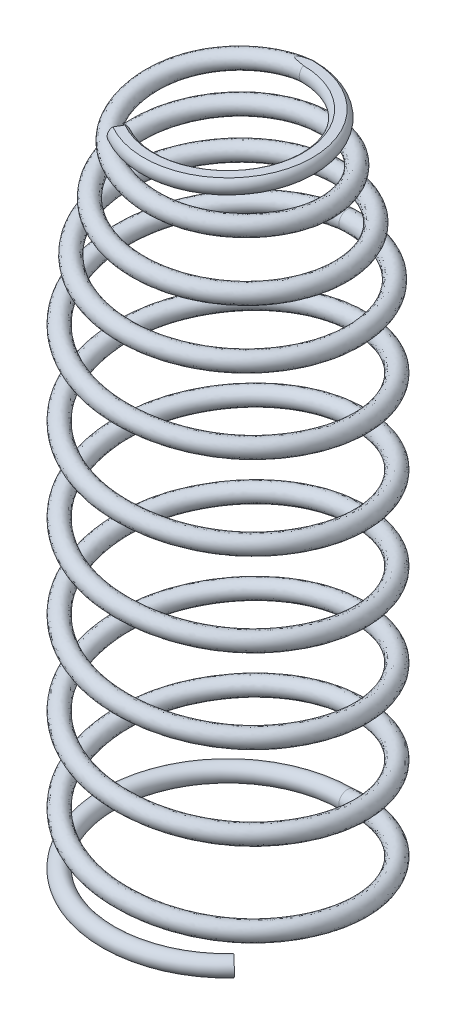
ISO-10303-21;
HEADER;
FILE_DESCRIPTION(('STEP AP214'),'2;1');
FILE_NAME('part.step','',(''),(''),'','','');
FILE_SCHEMA(('AUTOMOTIVE_DESIGN { 1 0 10303 214 1 1 1 1 }'));
ENDSEC;
DATA;
#1=APPLICATION_CONTEXT('core data for automotive mechanical design processes');
#2=APPLICATION_PROTOCOL_DEFINITION('international standard','automotive_design',2000,#1);
#3=PRODUCT_CONTEXT('',#1,'mechanical');
#4=PRODUCT('Part','Part','',(#3));
#5=PRODUCT_RELATED_PRODUCT_CATEGORY('part','',(#4));
#6=PRODUCT_DEFINITION_FORMATION('','',#4);
#7=PRODUCT_DEFINITION_CONTEXT('part definition',#1,'design');
#8=PRODUCT_DEFINITION('design','',#6,#7);
#9=PRODUCT_DEFINITION_SHAPE('','',#8);
#10=(LENGTH_UNIT() NAMED_UNIT(*) SI_UNIT(.MILLI.,.METRE.));
#11=(NAMED_UNIT(*) PLANE_ANGLE_UNIT() SI_UNIT($,.RADIAN.));
#12=(NAMED_UNIT(*) SI_UNIT($,.STERADIAN.) SOLID_ANGLE_UNIT());
#13=UNCERTAINTY_MEASURE_WITH_UNIT(LENGTH_MEASURE(1.E-05),#10,'distance_accuracy_value','');
#14=(GEOMETRIC_REPRESENTATION_CONTEXT(3) GLOBAL_UNCERTAINTY_ASSIGNED_CONTEXT((#13)) GLOBAL_UNIT_ASSIGNED_CONTEXT((#10,
#11,#12)) REPRESENTATION_CONTEXT('',''));
#15=CARTESIAN_POINT('',(0.,0.,0.));
#16=DIRECTION('',(0.,0.,1.));
#17=DIRECTION('',(1.,0.,0.));
#18=AXIS2_PLACEMENT_3D('',#15,#16,#17);
#19=CARTESIAN_POINT('',(0.,0.,-2.59999999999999));
#20=CARTESIAN_POINT('',(1.50111069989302,0.141666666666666,-2.59999999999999));
#21=CARTESIAN_POINT('',(2.25166604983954,0.283333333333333,-1.3));
#22=CARTESIAN_POINT('',(3.00222139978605,0.424999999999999,0.));
#23=CARTESIAN_POINT('',(2.25166604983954,0.566666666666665,1.3));
#24=CARTESIAN_POINT('',(1.50111069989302,0.708333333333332,2.59999999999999));
#25=CARTESIAN_POINT('',(0.,0.849999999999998,2.59999999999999));
#26=CARTESIAN_POINT('',(-1.50111069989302,0.991666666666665,2.6));
#27=CARTESIAN_POINT('',(-2.25166604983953,1.13333333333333,1.3));
#28=CARTESIAN_POINT('',(-3.00222139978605,1.275,0.));
#29=CARTESIAN_POINT('',(-2.25166604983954,1.41666666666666,-1.3));
#30=CARTESIAN_POINT('',(-1.50111069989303,1.55833333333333,-2.59999999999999));
#31=CARTESIAN_POINT('',(0.,1.7,-2.59999999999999));
#32=CARTESIAN_POINT('',(1.50111069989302,1.84166666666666,-2.59999999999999));
#33=CARTESIAN_POINT('',(2.25166604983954,1.98333333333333,-1.3));
#34=CARTESIAN_POINT('',(3.00222139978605,2.125,0.));
#35=CARTESIAN_POINT('',(2.25166604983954,2.26666666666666,1.3));
#36=CARTESIAN_POINT('',(1.50111069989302,2.40833333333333,2.59999999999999));
#37=CARTESIAN_POINT('',(0.,2.54999999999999,2.59999999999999));
#38=CARTESIAN_POINT('',(-1.50111069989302,2.69166666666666,2.6));
#39=CARTESIAN_POINT('',(-2.25166604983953,2.83333333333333,1.3));
#40=CARTESIAN_POINT('',(-3.00222139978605,2.97499999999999,0.));
#41=CARTESIAN_POINT('',(-2.25166604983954,3.11666666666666,-1.3));
#42=CARTESIAN_POINT('',(-1.50111069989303,3.25833333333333,-2.59999999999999));
#43=CARTESIAN_POINT('',(0.,3.39999999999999,-2.59999999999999));
#44=CARTESIAN_POINT('',(1.50111069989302,3.54166666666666,-2.59999999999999));
#45=CARTESIAN_POINT('',(2.25166604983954,3.68333333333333,-1.3));
#46=CARTESIAN_POINT('',(3.00222139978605,3.82499999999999,0.));
#47=CARTESIAN_POINT('',(2.25166604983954,3.96666666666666,1.3));
#48=CARTESIAN_POINT('',(1.50111069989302,4.10833333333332,2.59999999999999));
#49=CARTESIAN_POINT('',(0.,4.24999999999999,2.59999999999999));
#50=CARTESIAN_POINT('',(-1.50111069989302,4.39166666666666,2.6));
#51=CARTESIAN_POINT('',(-2.25166604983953,4.53333333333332,1.3));
#52=CARTESIAN_POINT('',(-3.00222139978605,4.67499999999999,0.));
#53=CARTESIAN_POINT('',(-2.25166604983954,4.81666666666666,-1.3));
#54=CARTESIAN_POINT('',(-1.50111069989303,4.95833333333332,-2.59999999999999));
#55=CARTESIAN_POINT('',(0.,5.09999999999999,-2.59999999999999));
#56=CARTESIAN_POINT('',(1.50111069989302,5.24166666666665,-2.59999999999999));
#57=CARTESIAN_POINT('',(2.25166604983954,5.38333333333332,-1.3));
#58=CARTESIAN_POINT('',(3.00222139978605,5.52499999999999,0.));
#59=CARTESIAN_POINT('',(2.25166604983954,5.66666666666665,1.3));
#60=CARTESIAN_POINT('',(1.50111069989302,5.80833333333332,2.59999999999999));
#61=CARTESIAN_POINT('',(0.,5.94999999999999,2.59999999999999));
#62=CARTESIAN_POINT('',(-1.50111069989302,6.09166666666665,2.6));
#63=CARTESIAN_POINT('',(-2.25166604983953,6.23333333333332,1.3));
#64=CARTESIAN_POINT('',(-3.00222139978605,6.37499999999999,0.));
#65=CARTESIAN_POINT('',(-2.25166604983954,6.51666666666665,-1.3));
#66=CARTESIAN_POINT('',(-1.50111069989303,6.65833333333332,-2.59999999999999));
#67=CARTESIAN_POINT('',(0.,6.79999999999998,-2.59999999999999));
#68=CARTESIAN_POINT('',(1.50111069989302,6.94166666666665,-2.59999999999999));
#69=CARTESIAN_POINT('',(2.25166604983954,7.08333333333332,-1.3));
#70=CARTESIAN_POINT('',(3.00222139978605,7.22499999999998,0.));
#71=CARTESIAN_POINT('',(2.25166604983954,7.36666666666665,1.3));
#72=CARTESIAN_POINT('',(1.50111069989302,7.50833333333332,2.59999999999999));
#73=CARTESIAN_POINT('',(0.,7.64999999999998,2.59999999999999));
#74=CARTESIAN_POINT('',(-1.50111069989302,7.79166666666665,2.6));
#75=CARTESIAN_POINT('',(-2.25166604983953,7.93333333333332,1.3));
#76=CARTESIAN_POINT('',(-3.00222139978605,8.07499999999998,0.));
#77=CARTESIAN_POINT('',(-2.25166604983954,8.21666666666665,-1.3));
#78=CARTESIAN_POINT('',(-1.50111069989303,8.35833333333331,-2.59999999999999));
#79=CARTESIAN_POINT('',(0.,8.49999999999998,-2.59999999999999));
#80=CARTESIAN_POINT('',(1.50111069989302,8.64166666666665,-2.59999999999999));
#81=CARTESIAN_POINT('',(2.25166604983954,8.78333333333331,-1.3));
#82=CARTESIAN_POINT('',(3.00222139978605,8.92499999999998,0.));
#83=CARTESIAN_POINT('',(2.25166604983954,9.06666666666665,1.3));
#84=CARTESIAN_POINT('',(1.50111069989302,9.20833333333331,2.59999999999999));
#85=CARTESIAN_POINT('',(0.,9.34999999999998,2.59999999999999));
#86=CARTESIAN_POINT('',(-1.50111069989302,9.49166666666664,2.6));
#87=CARTESIAN_POINT('',(-2.25166604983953,9.63333333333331,1.3));
#88=CARTESIAN_POINT('',(-3.00222139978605,9.77499999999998,0.));
#89=CARTESIAN_POINT('',(-2.25166604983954,9.91666666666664,-1.3));
#90=CARTESIAN_POINT('',(-1.50111069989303,10.0583333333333,-2.59999999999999));
#91=CARTESIAN_POINT('',(0.,10.2,-2.59999999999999));
#92=CARTESIAN_POINT('',(0.,0.35,-2.59999999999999));
#93=CARTESIAN_POINT('',(1.50111069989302,0.491666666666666,-2.59999999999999));
#94=CARTESIAN_POINT('',(2.25166604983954,0.633333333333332,-1.3));
#95=CARTESIAN_POINT('',(3.00222139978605,0.774999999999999,0.));
#96=CARTESIAN_POINT('',(2.25166604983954,0.916666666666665,1.3));
#97=CARTESIAN_POINT('',(1.50111069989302,1.05833333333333,2.59999999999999));
#98=CARTESIAN_POINT('',(0.,1.2,2.59999999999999));
#99=CARTESIAN_POINT('',(-1.50111069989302,1.34166666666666,2.6));
#100=CARTESIAN_POINT('',(-2.25166604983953,1.48333333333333,1.3));
#101=CARTESIAN_POINT('',(-3.00222139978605,1.625,0.));
#102=CARTESIAN_POINT('',(-2.25166604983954,1.76666666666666,-1.3));
#103=CARTESIAN_POINT('',(-1.50111069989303,1.90833333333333,-2.59999999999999));
#104=CARTESIAN_POINT('',(0.,2.05,-2.59999999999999));
#105=CARTESIAN_POINT('',(1.50111069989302,2.19166666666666,-2.59999999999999));
#106=CARTESIAN_POINT('',(2.25166604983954,2.33333333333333,-1.3));
#107=CARTESIAN_POINT('',(3.00222139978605,2.475,0.));
#108=CARTESIAN_POINT('',(2.25166604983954,2.61666666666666,1.3));
#109=CARTESIAN_POINT('',(1.50111069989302,2.75833333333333,2.59999999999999));
#110=CARTESIAN_POINT('',(0.,2.89999999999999,2.59999999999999));
#111=CARTESIAN_POINT('',(-1.50111069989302,3.04166666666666,2.6));
#112=CARTESIAN_POINT('',(-2.25166604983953,3.18333333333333,1.3));
#113=CARTESIAN_POINT('',(-3.00222139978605,3.32499999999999,0.));
#114=CARTESIAN_POINT('',(-2.25166604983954,3.46666666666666,-1.3));
#115=CARTESIAN_POINT('',(-1.50111069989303,3.60833333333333,-2.59999999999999));
#116=CARTESIAN_POINT('',(0.,3.74999999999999,-2.59999999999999));
#117=CARTESIAN_POINT('',(1.50111069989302,3.89166666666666,-2.59999999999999));
#118=CARTESIAN_POINT('',(2.25166604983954,4.03333333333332,-1.3));
#119=CARTESIAN_POINT('',(3.00222139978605,4.17499999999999,0.));
#120=CARTESIAN_POINT('',(2.25166604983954,4.31666666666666,1.3));
#121=CARTESIAN_POINT('',(1.50111069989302,4.45833333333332,2.59999999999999));
#122=CARTESIAN_POINT('',(0.,4.59999999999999,2.59999999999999));
#123=CARTESIAN_POINT('',(-1.50111069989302,4.74166666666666,2.6));
#124=CARTESIAN_POINT('',(-2.25166604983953,4.88333333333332,1.3));
#125=CARTESIAN_POINT('',(-3.00222139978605,5.02499999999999,0.));
#126=CARTESIAN_POINT('',(-2.25166604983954,5.16666666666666,-1.3));
#127=CARTESIAN_POINT('',(-1.50111069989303,5.30833333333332,-2.59999999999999));
#128=CARTESIAN_POINT('',(0.,5.44999999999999,-2.59999999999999));
#129=CARTESIAN_POINT('',(1.50111069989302,5.59166666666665,-2.59999999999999));
#130=CARTESIAN_POINT('',(2.25166604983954,5.73333333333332,-1.3));
#131=CARTESIAN_POINT('',(3.00222139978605,5.87499999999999,0.));
#132=CARTESIAN_POINT('',(2.25166604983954,6.01666666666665,1.3));
#133=CARTESIAN_POINT('',(1.50111069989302,6.15833333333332,2.59999999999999));
#134=CARTESIAN_POINT('',(0.,6.29999999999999,2.59999999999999));
#135=CARTESIAN_POINT('',(-1.50111069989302,6.44166666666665,2.6));
#136=CARTESIAN_POINT('',(-2.25166604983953,6.58333333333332,1.3));
#137=CARTESIAN_POINT('',(-3.00222139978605,6.72499999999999,0.));
#138=CARTESIAN_POINT('',(-2.25166604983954,6.86666666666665,-1.3));
#139=CARTESIAN_POINT('',(-1.50111069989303,7.00833333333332,-2.59999999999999));
#140=CARTESIAN_POINT('',(0.,7.14999999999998,-2.59999999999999));
#141=CARTESIAN_POINT('',(1.50111069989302,7.29166666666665,-2.59999999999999));
#142=CARTESIAN_POINT('',(2.25166604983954,7.43333333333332,-1.3));
#143=CARTESIAN_POINT('',(3.00222139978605,7.57499999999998,0.));
#144=CARTESIAN_POINT('',(2.25166604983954,7.71666666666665,1.3));
#145=CARTESIAN_POINT('',(1.50111069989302,7.85833333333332,2.59999999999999));
#146=CARTESIAN_POINT('',(0.,7.99999999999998,2.59999999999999));
#147=CARTESIAN_POINT('',(-1.50111069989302,8.14166666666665,2.6));
#148=CARTESIAN_POINT('',(-2.25166604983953,8.28333333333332,1.3));
#149=CARTESIAN_POINT('',(-3.00222139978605,8.42499999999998,0.));
#150=CARTESIAN_POINT('',(-2.25166604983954,8.56666666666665,-1.3));
#151=CARTESIAN_POINT('',(-1.50111069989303,8.70833333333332,-2.59999999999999));
#152=CARTESIAN_POINT('',(0.,8.84999999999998,-2.59999999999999));
#153=CARTESIAN_POINT('',(1.50111069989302,8.99166666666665,-2.59999999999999));
#154=CARTESIAN_POINT('',(2.25166604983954,9.13333333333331,-1.3));
#155=CARTESIAN_POINT('',(3.00222139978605,9.27499999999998,0.));
#156=CARTESIAN_POINT('',(2.25166604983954,9.41666666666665,1.3));
#157=CARTESIAN_POINT('',(1.50111069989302,9.55833333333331,2.59999999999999));
#158=CARTESIAN_POINT('',(0.,9.69999999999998,2.59999999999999));
#159=CARTESIAN_POINT('',(-1.50111069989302,9.84166666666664,2.6));
#160=CARTESIAN_POINT('',(-2.25166604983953,9.98333333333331,1.3));
#161=CARTESIAN_POINT('',(-3.00222139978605,10.125,0.));
#162=CARTESIAN_POINT('',(-2.25166604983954,10.2666666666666,-1.3));
#163=CARTESIAN_POINT('',(-1.50111069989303,10.4083333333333,-2.59999999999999));
#164=CARTESIAN_POINT('',(0.,10.55,-2.59999999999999));
#165=CARTESIAN_POINT('',(0.,0.35,-2.24999999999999));
#166=CARTESIAN_POINT('',(1.29903810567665,0.491666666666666,-2.24999999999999));
#167=CARTESIAN_POINT('',(1.94855715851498,0.633333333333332,-1.125));
#168=CARTESIAN_POINT('',(2.59807621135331,0.774999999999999,0.));
#169=CARTESIAN_POINT('',(1.94855715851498,0.916666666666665,1.125));
#170=CARTESIAN_POINT('',(1.29903810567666,1.05833333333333,2.24999999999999));
#171=CARTESIAN_POINT('',(0.,1.2,2.24999999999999));
#172=CARTESIAN_POINT('',(-1.29903810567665,1.34166666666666,2.25));
#173=CARTESIAN_POINT('',(-1.94855715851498,1.48333333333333,1.125));
#174=CARTESIAN_POINT('',(-2.59807621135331,1.625,0.));
#175=CARTESIAN_POINT('',(-1.94855715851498,1.76666666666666,-1.125));
#176=CARTESIAN_POINT('',(-1.29903810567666,1.90833333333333,-2.24999999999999));
#177=CARTESIAN_POINT('',(0.,2.05,-2.24999999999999));
#178=CARTESIAN_POINT('',(1.29903810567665,2.19166666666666,-2.24999999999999));
#179=CARTESIAN_POINT('',(1.94855715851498,2.33333333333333,-1.125));
#180=CARTESIAN_POINT('',(2.59807621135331,2.475,0.));
#181=CARTESIAN_POINT('',(1.94855715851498,2.61666666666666,1.125));
#182=CARTESIAN_POINT('',(1.29903810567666,2.75833333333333,2.24999999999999));
#183=CARTESIAN_POINT('',(0.,2.89999999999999,2.24999999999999));
#184=CARTESIAN_POINT('',(-1.29903810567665,3.04166666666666,2.25));
#185=CARTESIAN_POINT('',(-1.94855715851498,3.18333333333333,1.125));
#186=CARTESIAN_POINT('',(-2.59807621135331,3.32499999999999,0.));
#187=CARTESIAN_POINT('',(-1.94855715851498,3.46666666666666,-1.125));
#188=CARTESIAN_POINT('',(-1.29903810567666,3.60833333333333,-2.24999999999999));
#189=CARTESIAN_POINT('',(0.,3.74999999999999,-2.24999999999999));
#190=CARTESIAN_POINT('',(1.29903810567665,3.89166666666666,-2.24999999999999));
#191=CARTESIAN_POINT('',(1.94855715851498,4.03333333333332,-1.125));
#192=CARTESIAN_POINT('',(2.59807621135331,4.17499999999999,0.));
#193=CARTESIAN_POINT('',(1.94855715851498,4.31666666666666,1.125));
#194=CARTESIAN_POINT('',(1.29903810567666,4.45833333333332,2.24999999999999));
#195=CARTESIAN_POINT('',(0.,4.59999999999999,2.24999999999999));
#196=CARTESIAN_POINT('',(-1.29903810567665,4.74166666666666,2.25));
#197=CARTESIAN_POINT('',(-1.94855715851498,4.88333333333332,1.125));
#198=CARTESIAN_POINT('',(-2.59807621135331,5.02499999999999,0.));
#199=CARTESIAN_POINT('',(-1.94855715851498,5.16666666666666,-1.125));
#200=CARTESIAN_POINT('',(-1.29903810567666,5.30833333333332,-2.24999999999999));
#201=CARTESIAN_POINT('',(0.,5.44999999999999,-2.24999999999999));
#202=CARTESIAN_POINT('',(1.29903810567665,5.59166666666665,-2.24999999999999));
#203=CARTESIAN_POINT('',(1.94855715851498,5.73333333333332,-1.125));
#204=CARTESIAN_POINT('',(2.59807621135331,5.87499999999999,0.));
#205=CARTESIAN_POINT('',(1.94855715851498,6.01666666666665,1.125));
#206=CARTESIAN_POINT('',(1.29903810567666,6.15833333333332,2.24999999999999));
#207=CARTESIAN_POINT('',(0.,6.29999999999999,2.24999999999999));
#208=CARTESIAN_POINT('',(-1.29903810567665,6.44166666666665,2.25));
#209=CARTESIAN_POINT('',(-1.94855715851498,6.58333333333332,1.125));
#210=CARTESIAN_POINT('',(-2.59807621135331,6.72499999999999,0.));
#211=CARTESIAN_POINT('',(-1.94855715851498,6.86666666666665,-1.125));
#212=CARTESIAN_POINT('',(-1.29903810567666,7.00833333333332,-2.24999999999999));
#213=CARTESIAN_POINT('',(0.,7.14999999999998,-2.24999999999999));
#214=CARTESIAN_POINT('',(1.29903810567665,7.29166666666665,-2.24999999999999));
#215=CARTESIAN_POINT('',(1.94855715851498,7.43333333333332,-1.125));
#216=CARTESIAN_POINT('',(2.59807621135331,7.57499999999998,0.));
#217=CARTESIAN_POINT('',(1.94855715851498,7.71666666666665,1.125));
#218=CARTESIAN_POINT('',(1.29903810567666,7.85833333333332,2.24999999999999));
#219=CARTESIAN_POINT('',(0.,7.99999999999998,2.24999999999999));
#220=CARTESIAN_POINT('',(-1.29903810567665,8.14166666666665,2.25));
#221=CARTESIAN_POINT('',(-1.94855715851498,8.28333333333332,1.125));
#222=CARTESIAN_POINT('',(-2.59807621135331,8.42499999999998,0.));
#223=CARTESIAN_POINT('',(-1.94855715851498,8.56666666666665,-1.125));
#224=CARTESIAN_POINT('',(-1.29903810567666,8.70833333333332,-2.24999999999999));
#225=CARTESIAN_POINT('',(0.,8.84999999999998,-2.24999999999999));
#226=CARTESIAN_POINT('',(1.29903810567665,8.99166666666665,-2.24999999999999));
#227=CARTESIAN_POINT('',(1.94855715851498,9.13333333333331,-1.125));
#228=CARTESIAN_POINT('',(2.59807621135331,9.27499999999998,0.));
#229=CARTESIAN_POINT('',(1.94855715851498,9.41666666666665,1.125));
#230=CARTESIAN_POINT('',(1.29903810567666,9.55833333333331,2.24999999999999));
#231=CARTESIAN_POINT('',(0.,9.69999999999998,2.24999999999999));
#232=CARTESIAN_POINT('',(-1.29903810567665,9.84166666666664,2.25));
#233=CARTESIAN_POINT('',(-1.94855715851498,9.98333333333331,1.125));
#234=CARTESIAN_POINT('',(-2.59807621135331,10.125,0.));
#235=CARTESIAN_POINT('',(-1.94855715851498,10.2666666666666,-1.125));
#236=CARTESIAN_POINT('',(-1.29903810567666,10.4083333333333,-2.24999999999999));
#237=CARTESIAN_POINT('',(0.,10.55,-2.24999999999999));
#238=CARTESIAN_POINT('',(0.,0.,-2.25));
#239=CARTESIAN_POINT('',(1.29903810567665,0.141666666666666,-2.25));
#240=CARTESIAN_POINT('',(1.94855715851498,0.283333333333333,-1.125));
#241=CARTESIAN_POINT('',(2.59807621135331,0.424999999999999,0.));
#242=CARTESIAN_POINT('',(1.94855715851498,0.566666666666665,1.125));
#243=CARTESIAN_POINT('',(1.29903810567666,0.708333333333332,2.24999999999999));
#244=CARTESIAN_POINT('',(0.,0.849999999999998,2.25));
#245=CARTESIAN_POINT('',(-1.29903810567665,0.991666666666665,2.25));
#246=CARTESIAN_POINT('',(-1.94855715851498,1.13333333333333,1.125));
#247=CARTESIAN_POINT('',(-2.59807621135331,1.275,0.));
#248=CARTESIAN_POINT('',(-1.94855715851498,1.41666666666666,-1.125));
#249=CARTESIAN_POINT('',(-1.29903810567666,1.55833333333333,-2.24999999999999));
#250=CARTESIAN_POINT('',(0.,1.7,-2.25));
#251=CARTESIAN_POINT('',(1.29903810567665,1.84166666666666,-2.25));
#252=CARTESIAN_POINT('',(1.94855715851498,1.98333333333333,-1.125));
#253=CARTESIAN_POINT('',(2.59807621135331,2.125,0.));
#254=CARTESIAN_POINT('',(1.94855715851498,2.26666666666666,1.125));
#255=CARTESIAN_POINT('',(1.29903810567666,2.40833333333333,2.24999999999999));
#256=CARTESIAN_POINT('',(0.,2.54999999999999,2.25));
#257=CARTESIAN_POINT('',(-1.29903810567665,2.69166666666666,2.25));
#258=CARTESIAN_POINT('',(-1.94855715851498,2.83333333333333,1.125));
#259=CARTESIAN_POINT('',(-2.59807621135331,2.97499999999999,0.));
#260=CARTESIAN_POINT('',(-1.94855715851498,3.11666666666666,-1.125));
#261=CARTESIAN_POINT('',(-1.29903810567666,3.25833333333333,-2.24999999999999));
#262=CARTESIAN_POINT('',(0.,3.39999999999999,-2.25));
#263=CARTESIAN_POINT('',(1.29903810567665,3.54166666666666,-2.25));
#264=CARTESIAN_POINT('',(1.94855715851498,3.68333333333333,-1.125));
#265=CARTESIAN_POINT('',(2.59807621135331,3.82499999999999,0.));
#266=CARTESIAN_POINT('',(1.94855715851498,3.96666666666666,1.125));
#267=CARTESIAN_POINT('',(1.29903810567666,4.10833333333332,2.24999999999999));
#268=CARTESIAN_POINT('',(0.,4.24999999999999,2.25));
#269=CARTESIAN_POINT('',(-1.29903810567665,4.39166666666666,2.25));
#270=CARTESIAN_POINT('',(-1.94855715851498,4.53333333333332,1.125));
#271=CARTESIAN_POINT('',(-2.59807621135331,4.67499999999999,0.));
#272=CARTESIAN_POINT('',(-1.94855715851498,4.81666666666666,-1.125));
#273=CARTESIAN_POINT('',(-1.29903810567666,4.95833333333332,-2.24999999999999));
#274=CARTESIAN_POINT('',(0.,5.09999999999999,-2.25));
#275=CARTESIAN_POINT('',(1.29903810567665,5.24166666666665,-2.25));
#276=CARTESIAN_POINT('',(1.94855715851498,5.38333333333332,-1.125));
#277=CARTESIAN_POINT('',(2.59807621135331,5.52499999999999,0.));
#278=CARTESIAN_POINT('',(1.94855715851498,5.66666666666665,1.125));
#279=CARTESIAN_POINT('',(1.29903810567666,5.80833333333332,2.24999999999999));
#280=CARTESIAN_POINT('',(0.,5.94999999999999,2.25));
#281=CARTESIAN_POINT('',(-1.29903810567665,6.09166666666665,2.25));
#282=CARTESIAN_POINT('',(-1.94855715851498,6.23333333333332,1.125));
#283=CARTESIAN_POINT('',(-2.59807621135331,6.37499999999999,0.));
#284=CARTESIAN_POINT('',(-1.94855715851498,6.51666666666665,-1.125));
#285=CARTESIAN_POINT('',(-1.29903810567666,6.65833333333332,-2.24999999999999));
#286=CARTESIAN_POINT('',(0.,6.79999999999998,-2.25));
#287=CARTESIAN_POINT('',(1.29903810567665,6.94166666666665,-2.25));
#288=CARTESIAN_POINT('',(1.94855715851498,7.08333333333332,-1.125));
#289=CARTESIAN_POINT('',(2.59807621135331,7.22499999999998,0.));
#290=CARTESIAN_POINT('',(1.94855715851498,7.36666666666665,1.125));
#291=CARTESIAN_POINT('',(1.29903810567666,7.50833333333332,2.24999999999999));
#292=CARTESIAN_POINT('',(0.,7.64999999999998,2.25));
#293=CARTESIAN_POINT('',(-1.29903810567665,7.79166666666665,2.25));
#294=CARTESIAN_POINT('',(-1.94855715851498,7.93333333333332,1.125));
#295=CARTESIAN_POINT('',(-2.59807621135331,8.07499999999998,0.));
#296=CARTESIAN_POINT('',(-1.94855715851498,8.21666666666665,-1.125));
#297=CARTESIAN_POINT('',(-1.29903810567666,8.35833333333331,-2.24999999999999));
#298=CARTESIAN_POINT('',(0.,8.49999999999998,-2.25));
#299=CARTESIAN_POINT('',(1.29903810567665,8.64166666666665,-2.25));
#300=CARTESIAN_POINT('',(1.94855715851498,8.78333333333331,-1.125));
#301=CARTESIAN_POINT('',(2.59807621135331,8.92499999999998,0.));
#302=CARTESIAN_POINT('',(1.94855715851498,9.06666666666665,1.125));
#303=CARTESIAN_POINT('',(1.29903810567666,9.20833333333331,2.24999999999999));
#304=CARTESIAN_POINT('',(0.,9.34999999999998,2.25));
#305=CARTESIAN_POINT('',(-1.29903810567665,9.49166666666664,2.25));
#306=CARTESIAN_POINT('',(-1.94855715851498,9.63333333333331,1.125));
#307=CARTESIAN_POINT('',(-2.59807621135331,9.77499999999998,0.));
#308=CARTESIAN_POINT('',(-1.94855715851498,9.91666666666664,-1.125));
#309=CARTESIAN_POINT('',(-1.29903810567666,10.0583333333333,-2.24999999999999));
#310=CARTESIAN_POINT('',(0.,10.2,-2.25));
#311=CARTESIAN_POINT('',(0.,-0.35,-2.24999999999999));
#312=CARTESIAN_POINT('',(1.29903810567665,-0.208333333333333,-2.24999999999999));
#313=CARTESIAN_POINT('',(1.94855715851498,-0.066666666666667,-1.125));
#314=CARTESIAN_POINT('',(2.59807621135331,0.0749999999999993,0.));
#315=CARTESIAN_POINT('',(1.94855715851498,0.216666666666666,1.125));
#316=CARTESIAN_POINT('',(1.29903810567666,0.358333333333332,2.24999999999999));
#317=CARTESIAN_POINT('',(0.,0.499999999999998,2.24999999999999));
#318=CARTESIAN_POINT('',(-1.29903810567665,0.641666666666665,2.25));
#319=CARTESIAN_POINT('',(-1.94855715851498,0.783333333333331,1.125));
#320=CARTESIAN_POINT('',(-2.59807621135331,0.924999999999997,0.));
#321=CARTESIAN_POINT('',(-1.94855715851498,1.06666666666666,-1.125));
#322=CARTESIAN_POINT('',(-1.29903810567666,1.20833333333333,-2.24999999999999));
#323=CARTESIAN_POINT('',(0.,1.35,-2.24999999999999));
#324=CARTESIAN_POINT('',(1.29903810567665,1.49166666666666,-2.24999999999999));
#325=CARTESIAN_POINT('',(1.94855715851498,1.63333333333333,-1.125));
#326=CARTESIAN_POINT('',(2.59807621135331,1.775,0.));
#327=CARTESIAN_POINT('',(1.94855715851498,1.91666666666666,1.125));
#328=CARTESIAN_POINT('',(1.29903810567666,2.05833333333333,2.24999999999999));
#329=CARTESIAN_POINT('',(0.,2.19999999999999,2.24999999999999));
#330=CARTESIAN_POINT('',(-1.29903810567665,2.34166666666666,2.25));
#331=CARTESIAN_POINT('',(-1.94855715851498,2.48333333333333,1.125));
#332=CARTESIAN_POINT('',(-2.59807621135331,2.62499999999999,0.));
#333=CARTESIAN_POINT('',(-1.94855715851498,2.76666666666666,-1.125));
#334=CARTESIAN_POINT('',(-1.29903810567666,2.90833333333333,-2.24999999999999));
#335=CARTESIAN_POINT('',(0.,3.04999999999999,-2.24999999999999));
#336=CARTESIAN_POINT('',(1.29903810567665,3.19166666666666,-2.24999999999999));
#337=CARTESIAN_POINT('',(1.94855715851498,3.33333333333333,-1.125));
#338=CARTESIAN_POINT('',(2.59807621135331,3.47499999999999,0.));
#339=CARTESIAN_POINT('',(1.94855715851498,3.61666666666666,1.125));
#340=CARTESIAN_POINT('',(1.29903810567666,3.75833333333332,2.24999999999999));
#341=CARTESIAN_POINT('',(0.,3.89999999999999,2.24999999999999));
#342=CARTESIAN_POINT('',(-1.29903810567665,4.04166666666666,2.25));
#343=CARTESIAN_POINT('',(-1.94855715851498,4.18333333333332,1.125));
#344=CARTESIAN_POINT('',(-2.59807621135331,4.32499999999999,0.));
#345=CARTESIAN_POINT('',(-1.94855715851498,4.46666666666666,-1.125));
#346=CARTESIAN_POINT('',(-1.29903810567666,4.60833333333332,-2.24999999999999));
#347=CARTESIAN_POINT('',(0.,4.74999999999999,-2.24999999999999));
#348=CARTESIAN_POINT('',(1.29903810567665,4.89166666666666,-2.24999999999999));
#349=CARTESIAN_POINT('',(1.94855715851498,5.03333333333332,-1.125));
#350=CARTESIAN_POINT('',(2.59807621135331,5.17499999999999,0.));
#351=CARTESIAN_POINT('',(1.94855715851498,5.31666666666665,1.125));
#352=CARTESIAN_POINT('',(1.29903810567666,5.45833333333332,2.24999999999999));
#353=CARTESIAN_POINT('',(0.,5.59999999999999,2.24999999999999));
#354=CARTESIAN_POINT('',(-1.29903810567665,5.74166666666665,2.25));
#355=CARTESIAN_POINT('',(-1.94855715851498,5.88333333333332,1.125));
#356=CARTESIAN_POINT('',(-2.59807621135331,6.02499999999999,0.));
#357=CARTESIAN_POINT('',(-1.94855715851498,6.16666666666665,-1.125));
#358=CARTESIAN_POINT('',(-1.29903810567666,6.30833333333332,-2.24999999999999));
#359=CARTESIAN_POINT('',(0.,6.44999999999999,-2.24999999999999));
#360=CARTESIAN_POINT('',(1.29903810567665,6.59166666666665,-2.24999999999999));
#361=CARTESIAN_POINT('',(1.94855715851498,6.73333333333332,-1.125));
#362=CARTESIAN_POINT('',(2.59807621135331,6.87499999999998,0.));
#363=CARTESIAN_POINT('',(1.94855715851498,7.01666666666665,1.125));
#364=CARTESIAN_POINT('',(1.29903810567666,7.15833333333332,2.24999999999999));
#365=CARTESIAN_POINT('',(0.,7.29999999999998,2.24999999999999));
#366=CARTESIAN_POINT('',(-1.29903810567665,7.44166666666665,2.25));
#367=CARTESIAN_POINT('',(-1.94855715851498,7.58333333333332,1.125));
#368=CARTESIAN_POINT('',(-2.59807621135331,7.72499999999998,0.));
#369=CARTESIAN_POINT('',(-1.94855715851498,7.86666666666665,-1.125));
#370=CARTESIAN_POINT('',(-1.29903810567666,8.00833333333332,-2.24999999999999));
#371=CARTESIAN_POINT('',(0.,8.14999999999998,-2.24999999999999));
#372=CARTESIAN_POINT('',(1.29903810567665,8.29166666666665,-2.24999999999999));
#373=CARTESIAN_POINT('',(1.94855715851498,8.43333333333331,-1.125));
#374=CARTESIAN_POINT('',(2.59807621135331,8.57499999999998,0.));
#375=CARTESIAN_POINT('',(1.94855715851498,8.71666666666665,1.125));
#376=CARTESIAN_POINT('',(1.29903810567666,8.85833333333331,2.24999999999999));
#377=CARTESIAN_POINT('',(0.,8.99999999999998,2.24999999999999));
#378=CARTESIAN_POINT('',(-1.29903810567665,9.14166666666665,2.25));
#379=CARTESIAN_POINT('',(-1.94855715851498,9.28333333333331,1.125));
#380=CARTESIAN_POINT('',(-2.59807621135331,9.42499999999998,0.));
#381=CARTESIAN_POINT('',(-1.94855715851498,9.56666666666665,-1.125));
#382=CARTESIAN_POINT('',(-1.29903810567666,9.70833333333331,-2.24999999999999));
#383=CARTESIAN_POINT('',(0.,9.84999999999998,-2.24999999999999));
#384=CARTESIAN_POINT('',(0.,-0.35,-2.59999999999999));
#385=CARTESIAN_POINT('',(1.50111069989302,-0.208333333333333,-2.59999999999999));
#386=CARTESIAN_POINT('',(2.25166604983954,-0.066666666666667,-1.3));
#387=CARTESIAN_POINT('',(3.00222139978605,0.0749999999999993,0.));
#388=CARTESIAN_POINT('',(2.25166604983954,0.216666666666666,1.3));
#389=CARTESIAN_POINT('',(1.50111069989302,0.358333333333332,2.59999999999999));
#390=CARTESIAN_POINT('',(0.,0.499999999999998,2.59999999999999));
#391=CARTESIAN_POINT('',(-1.50111069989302,0.641666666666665,2.6));
#392=CARTESIAN_POINT('',(-2.25166604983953,0.783333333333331,1.3));
#393=CARTESIAN_POINT('',(-3.00222139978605,0.924999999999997,0.));
#394=CARTESIAN_POINT('',(-2.25166604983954,1.06666666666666,-1.3));
#395=CARTESIAN_POINT('',(-1.50111069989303,1.20833333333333,-2.59999999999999));
#396=CARTESIAN_POINT('',(0.,1.35,-2.59999999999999));
#397=CARTESIAN_POINT('',(1.50111069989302,1.49166666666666,-2.59999999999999));
#398=CARTESIAN_POINT('',(2.25166604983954,1.63333333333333,-1.3));
#399=CARTESIAN_POINT('',(3.00222139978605,1.775,0.));
#400=CARTESIAN_POINT('',(2.25166604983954,1.91666666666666,1.3));
#401=CARTESIAN_POINT('',(1.50111069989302,2.05833333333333,2.59999999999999));
#402=CARTESIAN_POINT('',(0.,2.19999999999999,2.59999999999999));
#403=CARTESIAN_POINT('',(-1.50111069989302,2.34166666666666,2.6));
#404=CARTESIAN_POINT('',(-2.25166604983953,2.48333333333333,1.3));
#405=CARTESIAN_POINT('',(-3.00222139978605,2.62499999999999,0.));
#406=CARTESIAN_POINT('',(-2.25166604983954,2.76666666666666,-1.3));
#407=CARTESIAN_POINT('',(-1.50111069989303,2.90833333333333,-2.59999999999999));
#408=CARTESIAN_POINT('',(0.,3.04999999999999,-2.59999999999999));
#409=CARTESIAN_POINT('',(1.50111069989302,3.19166666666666,-2.59999999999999));
#410=CARTESIAN_POINT('',(2.25166604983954,3.33333333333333,-1.3));
#411=CARTESIAN_POINT('',(3.00222139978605,3.47499999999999,0.));
#412=CARTESIAN_POINT('',(2.25166604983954,3.61666666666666,1.3));
#413=CARTESIAN_POINT('',(1.50111069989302,3.75833333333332,2.59999999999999));
#414=CARTESIAN_POINT('',(0.,3.89999999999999,2.59999999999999));
#415=CARTESIAN_POINT('',(-1.50111069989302,4.04166666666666,2.6));
#416=CARTESIAN_POINT('',(-2.25166604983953,4.18333333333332,1.3));
#417=CARTESIAN_POINT('',(-3.00222139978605,4.32499999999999,0.));
#418=CARTESIAN_POINT('',(-2.25166604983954,4.46666666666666,-1.3));
#419=CARTESIAN_POINT('',(-1.50111069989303,4.60833333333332,-2.59999999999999));
#420=CARTESIAN_POINT('',(0.,4.74999999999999,-2.59999999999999));
#421=CARTESIAN_POINT('',(1.50111069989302,4.89166666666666,-2.59999999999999));
#422=CARTESIAN_POINT('',(2.25166604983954,5.03333333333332,-1.3));
#423=CARTESIAN_POINT('',(3.00222139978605,5.17499999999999,0.));
#424=CARTESIAN_POINT('',(2.25166604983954,5.31666666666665,1.3));
#425=CARTESIAN_POINT('',(1.50111069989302,5.45833333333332,2.59999999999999));
#426=CARTESIAN_POINT('',(0.,5.59999999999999,2.59999999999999));
#427=CARTESIAN_POINT('',(-1.50111069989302,5.74166666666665,2.6));
#428=CARTESIAN_POINT('',(-2.25166604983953,5.88333333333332,1.3));
#429=CARTESIAN_POINT('',(-3.00222139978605,6.02499999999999,0.));
#430=CARTESIAN_POINT('',(-2.25166604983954,6.16666666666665,-1.3));
#431=CARTESIAN_POINT('',(-1.50111069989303,6.30833333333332,-2.59999999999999));
#432=CARTESIAN_POINT('',(0.,6.44999999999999,-2.59999999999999));
#433=CARTESIAN_POINT('',(1.50111069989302,6.59166666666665,-2.59999999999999));
#434=CARTESIAN_POINT('',(2.25166604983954,6.73333333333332,-1.3));
#435=CARTESIAN_POINT('',(3.00222139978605,6.87499999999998,0.));
#436=CARTESIAN_POINT('',(2.25166604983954,7.01666666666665,1.3));
#437=CARTESIAN_POINT('',(1.50111069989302,7.15833333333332,2.59999999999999));
#438=CARTESIAN_POINT('',(0.,7.29999999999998,2.59999999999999));
#439=CARTESIAN_POINT('',(-1.50111069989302,7.44166666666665,2.6));
#440=CARTESIAN_POINT('',(-2.25166604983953,7.58333333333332,1.3));
#441=CARTESIAN_POINT('',(-3.00222139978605,7.72499999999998,0.));
#442=CARTESIAN_POINT('',(-2.25166604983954,7.86666666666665,-1.3));
#443=CARTESIAN_POINT('',(-1.50111069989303,8.00833333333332,-2.59999999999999));
#444=CARTESIAN_POINT('',(0.,8.14999999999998,-2.59999999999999));
#445=CARTESIAN_POINT('',(1.50111069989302,8.29166666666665,-2.59999999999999));
#446=CARTESIAN_POINT('',(2.25166604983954,8.43333333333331,-1.3));
#447=CARTESIAN_POINT('',(3.00222139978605,8.57499999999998,0.));
#448=CARTESIAN_POINT('',(2.25166604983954,8.71666666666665,1.3));
#449=CARTESIAN_POINT('',(1.50111069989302,8.85833333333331,2.59999999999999));
#450=CARTESIAN_POINT('',(0.,8.99999999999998,2.59999999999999));
#451=CARTESIAN_POINT('',(-1.50111069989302,9.14166666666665,2.6));
#452=CARTESIAN_POINT('',(-2.25166604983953,9.28333333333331,1.3));
#453=CARTESIAN_POINT('',(-3.00222139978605,9.42499999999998,0.));
#454=CARTESIAN_POINT('',(-2.25166604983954,9.56666666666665,-1.3));
#455=CARTESIAN_POINT('',(-1.50111069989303,9.70833333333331,-2.59999999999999));
#456=CARTESIAN_POINT('',(0.,9.84999999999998,-2.59999999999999));
#457=CARTESIAN_POINT('',(0.,0.,-2.59999999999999));
#458=CARTESIAN_POINT('',(1.50111069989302,0.141666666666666,-2.59999999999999));
#459=CARTESIAN_POINT('',(2.25166604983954,0.283333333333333,-1.3));
#460=CARTESIAN_POINT('',(3.00222139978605,0.424999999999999,0.));
#461=CARTESIAN_POINT('',(2.25166604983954,0.566666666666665,1.3));
#462=CARTESIAN_POINT('',(1.50111069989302,0.708333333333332,2.59999999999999));
#463=CARTESIAN_POINT('',(0.,0.849999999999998,2.59999999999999));
#464=CARTESIAN_POINT('',(-1.50111069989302,0.991666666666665,2.6));
#465=CARTESIAN_POINT('',(-2.25166604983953,1.13333333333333,1.3));
#466=CARTESIAN_POINT('',(-3.00222139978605,1.275,0.));
#467=CARTESIAN_POINT('',(-2.25166604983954,1.41666666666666,-1.3));
#468=CARTESIAN_POINT('',(-1.50111069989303,1.55833333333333,-2.59999999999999));
#469=CARTESIAN_POINT('',(0.,1.7,-2.59999999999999));
#470=CARTESIAN_POINT('',(1.50111069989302,1.84166666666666,-2.59999999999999));
#471=CARTESIAN_POINT('',(2.25166604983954,1.98333333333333,-1.3));
#472=CARTESIAN_POINT('',(3.00222139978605,2.125,0.));
#473=CARTESIAN_POINT('',(2.25166604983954,2.26666666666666,1.3));
#474=CARTESIAN_POINT('',(1.50111069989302,2.40833333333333,2.59999999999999));
#475=CARTESIAN_POINT('',(0.,2.54999999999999,2.59999999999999));
#476=CARTESIAN_POINT('',(-1.50111069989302,2.69166666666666,2.6));
#477=CARTESIAN_POINT('',(-2.25166604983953,2.83333333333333,1.3));
#478=CARTESIAN_POINT('',(-3.00222139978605,2.97499999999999,0.));
#479=CARTESIAN_POINT('',(-2.25166604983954,3.11666666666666,-1.3));
#480=CARTESIAN_POINT('',(-1.50111069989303,3.25833333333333,-2.59999999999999));
#481=CARTESIAN_POINT('',(0.,3.39999999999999,-2.59999999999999));
#482=CARTESIAN_POINT('',(1.50111069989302,3.54166666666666,-2.59999999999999));
#483=CARTESIAN_POINT('',(2.25166604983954,3.68333333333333,-1.3));
#484=CARTESIAN_POINT('',(3.00222139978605,3.82499999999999,0.));
#485=CARTESIAN_POINT('',(2.25166604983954,3.96666666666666,1.3));
#486=CARTESIAN_POINT('',(1.50111069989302,4.10833333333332,2.59999999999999));
#487=CARTESIAN_POINT('',(0.,4.24999999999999,2.59999999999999));
#488=CARTESIAN_POINT('',(-1.50111069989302,4.39166666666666,2.6));
#489=CARTESIAN_POINT('',(-2.25166604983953,4.53333333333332,1.3));
#490=CARTESIAN_POINT('',(-3.00222139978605,4.67499999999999,0.));
#491=CARTESIAN_POINT('',(-2.25166604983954,4.81666666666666,-1.3));
#492=CARTESIAN_POINT('',(-1.50111069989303,4.95833333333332,-2.59999999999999));
#493=CARTESIAN_POINT('',(0.,5.09999999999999,-2.59999999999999));
#494=CARTESIAN_POINT('',(1.50111069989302,5.24166666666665,-2.59999999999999));
#495=CARTESIAN_POINT('',(2.25166604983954,5.38333333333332,-1.3));
#496=CARTESIAN_POINT('',(3.00222139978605,5.52499999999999,0.));
#497=CARTESIAN_POINT('',(2.25166604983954,5.66666666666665,1.3));
#498=CARTESIAN_POINT('',(1.50111069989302,5.80833333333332,2.59999999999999));
#499=CARTESIAN_POINT('',(0.,5.94999999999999,2.59999999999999));
#500=CARTESIAN_POINT('',(-1.50111069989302,6.09166666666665,2.6));
#501=CARTESIAN_POINT('',(-2.25166604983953,6.23333333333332,1.3));
#502=CARTESIAN_POINT('',(-3.00222139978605,6.37499999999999,0.));
#503=CARTESIAN_POINT('',(-2.25166604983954,6.51666666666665,-1.3));
#504=CARTESIAN_POINT('',(-1.50111069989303,6.65833333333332,-2.59999999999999));
#505=CARTESIAN_POINT('',(0.,6.79999999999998,-2.59999999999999));
#506=CARTESIAN_POINT('',(1.50111069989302,6.94166666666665,-2.59999999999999));
#507=CARTESIAN_POINT('',(2.25166604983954,7.08333333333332,-1.3));
#508=CARTESIAN_POINT('',(3.00222139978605,7.22499999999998,0.));
#509=CARTESIAN_POINT('',(2.25166604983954,7.36666666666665,1.3));
#510=CARTESIAN_POINT('',(1.50111069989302,7.50833333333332,2.59999999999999));
#511=CARTESIAN_POINT('',(0.,7.64999999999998,2.59999999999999));
#512=CARTESIAN_POINT('',(-1.50111069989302,7.79166666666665,2.6));
#513=CARTESIAN_POINT('',(-2.25166604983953,7.93333333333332,1.3));
#514=CARTESIAN_POINT('',(-3.00222139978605,8.07499999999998,0.));
#515=CARTESIAN_POINT('',(-2.25166604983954,8.21666666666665,-1.3));
#516=CARTESIAN_POINT('',(-1.50111069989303,8.35833333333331,-2.59999999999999));
#517=CARTESIAN_POINT('',(0.,8.49999999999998,-2.59999999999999));
#518=CARTESIAN_POINT('',(1.50111069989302,8.64166666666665,-2.59999999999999));
#519=CARTESIAN_POINT('',(2.25166604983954,8.78333333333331,-1.3));
#520=CARTESIAN_POINT('',(3.00222139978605,8.92499999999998,0.));
#521=CARTESIAN_POINT('',(2.25166604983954,9.06666666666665,1.3));
#522=CARTESIAN_POINT('',(1.50111069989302,9.20833333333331,2.59999999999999));
#523=CARTESIAN_POINT('',(0.,9.34999999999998,2.59999999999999));
#524=CARTESIAN_POINT('',(-1.50111069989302,9.49166666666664,2.6));
#525=CARTESIAN_POINT('',(-2.25166604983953,9.63333333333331,1.3));
#526=CARTESIAN_POINT('',(-3.00222139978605,9.77499999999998,0.));
#527=CARTESIAN_POINT('',(-2.25166604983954,9.91666666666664,-1.3));
#528=CARTESIAN_POINT('',(-1.50111069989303,10.0583333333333,-2.59999999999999));
#529=CARTESIAN_POINT('',(0.,10.2,-2.59999999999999));
#530=(BOUNDED_SURFACE() B_SPLINE_SURFACE(3,2,((#19,#20,#21,#22,#23,#24,#25,#26,#27,#28,#29,#30,
#31,#32,#33,#34,#35,#36,#37,#38,#39,#40,#41,#42,#43,#44,#45,#46,#47,#48,#49,#50,#51,#52,#53,#54,
#55,#56,#57,#58,#59,#60,#61,#62,#63,#64,#65,#66,#67,#68,#69,#70,#71,#72,#73,#74,#75,#76,#77,#78,
#79,#80,#81,#82,#83,#84,#85,#86,#87,#88,#89,#90,#91),(#92,#93,#94,#95,#96,#97,#98,#99,#100,#101,
#102,#103,#104,#105,#106,#107,#108,#109,#110,#111,#112,#113,#114,#115,#116,#117,#118,#119,#120,
#121,#122,#123,#124,#125,#126,#127,#128,#129,#130,#131,#132,#133,#134,#135,#136,#137,#138,#139,
#140,#141,#142,#143,#144,#145,#146,#147,#148,#149,#150,#151,#152,#153,#154,#155,#156,#157,#158,
#159,#160,#161,#162,#163,#164),(#165,#166,#167,#168,#169,#170,#171,#172,#173,#174,#175,#176,
#177,#178,#179,#180,#181,#182,#183,#184,#185,#186,#187,#188,#189,#190,#191,#192,#193,#194,#195,
#196,#197,#198,#199,#200,#201,#202,#203,#204,#205,#206,#207,#208,#209,#210,#211,#212,#213,#214,
#215,#216,#217,#218,#219,#220,#221,#222,#223,#224,#225,#226,#227,#228,#229,#230,#231,#232,#233,
#234,#235,#236,#237),(#238,#239,#240,#241,#242,#243,#244,#245,#246,#247,#248,#249,#250,#251,
#252,#253,#254,#255,#256,#257,#258,#259,#260,#261,#262,#263,#264,#265,#266,#267,#268,#269,#270,
#271,#272,#273,#274,#275,#276,#277,#278,#279,#280,#281,#282,#283,#284,#285,#286,#287,#288,#289,
#290,#291,#292,#293,#294,#295,#296,#297,#298,#299,#300,#301,#302,#303,#304,#305,#306,#307,#308,
#309,#310),(#311,#312,#313,#314,#315,#316,#317,#318,#319,#320,#321,#322,#323,#324,#325,#326,
#327,#328,#329,#330,#331,#332,#333,#334,#335,#336,#337,#338,#339,#340,#341,#342,#343,#344,#345,
#346,#347,#348,#349,#350,#351,#352,#353,#354,#355,#356,#357,#358,#359,#360,#361,#362,#363,#364,
#365,#366,#367,#368,#369,#370,#371,#372,#373,#374,#375,#376,#377,#378,#379,#380,#381,#382,#383),
(#384,#385,#386,#387,#388,#389,#390,#391,#392,#393,#394,#395,#396,#397,#398,#399,#400,#401,#402,
#403,#404,#405,#406,#407,#408,#409,#410,#411,#412,#413,#414,#415,#416,#417,#418,#419,#420,#421,
#422,#423,#424,#425,#426,#427,#428,#429,#430,#431,#432,#433,#434,#435,#436,#437,#438,#439,#440,
#441,#442,#443,#444,#445,#446,#447,#448,#449,#450,#451,#452,#453,#454,#455,#456),(#457,#458,
#459,#460,#461,#462,#463,#464,#465,#466,#467,#468,#469,#470,#471,#472,#473,#474,#475,#476,#477,
#478,#479,#480,#481,#482,#483,#484,#485,#486,#487,#488,#489,#490,#491,#492,#493,#494,#495,#496,
#497,#498,#499,#500,#501,#502,#503,#504,#505,#506,#507,#508,#509,#510,#511,#512,#513,#514,#515,
#516,#517,#518,#519,#520,#521,#522,#523,#524,#525,#526,#527,#528,#529)),.UNSPECIFIED.,.T.,.F.,
.F.) B_SPLINE_SURFACE_WITH_KNOTS((4,3,4),(3,2,2,2,2,2,2,2,2,2,2,2,2,2,2,2,2,2,2,2,2,2,2,2,2,2,2,
2,2,2,2,2,2,2,2,2,3),(0.,0.5,1.),(0.,0.0277777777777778,0.0555555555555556,0.0833333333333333,
0.111111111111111,0.138888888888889,0.166666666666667,0.194444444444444,0.222222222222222,0.25,
0.277777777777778,0.305555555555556,0.333333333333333,0.361111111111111,0.388888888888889,
0.416666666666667,0.444444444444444,0.472222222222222,0.5,0.527777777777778,0.555555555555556,
0.583333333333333,0.611111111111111,0.638888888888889,0.666666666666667,0.694444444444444,
0.722222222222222,0.75,0.777777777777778,0.805555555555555,0.833333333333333,0.861111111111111,
0.888888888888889,0.916666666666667,0.944444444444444,0.972222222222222,1.),
.UNSPECIFIED.) GEOMETRIC_REPRESENTATION_ITEM() RATIONAL_B_SPLINE_SURFACE(((1.,0.866025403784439,
1.,0.866025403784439,1.,0.866025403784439,1.,0.866025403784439,1.,0.866025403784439,1.,
0.866025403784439,1.,0.866025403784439,1.,0.866025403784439,1.,0.866025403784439,1.,
0.866025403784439,1.,0.866025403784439,1.,0.866025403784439,1.,0.866025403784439,1.,
0.866025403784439,1.,0.866025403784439,1.,0.866025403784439,1.,0.866025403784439,1.,
0.866025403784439,1.,0.866025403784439,1.,0.866025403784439,1.,0.866025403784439,1.,
0.866025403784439,1.,0.866025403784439,1.,0.866025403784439,1.,0.866025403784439,1.,
0.866025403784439,1.,0.866025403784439,1.,0.866025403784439,1.,0.866025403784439,1.,
0.866025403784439,1.,0.866025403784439,1.,0.866025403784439,1.,0.866025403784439,1.,
0.866025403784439,1.,0.866025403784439,1.,0.866025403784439,1.),(0.333333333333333,
0.288675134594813,0.333333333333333,0.288675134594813,0.333333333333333,0.288675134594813,
0.333333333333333,0.288675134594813,0.333333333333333,0.288675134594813,0.333333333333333,
0.288675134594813,0.333333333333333,0.288675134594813,0.333333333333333,0.288675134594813,
0.333333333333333,0.288675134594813,0.333333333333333,0.288675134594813,0.333333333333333,
0.288675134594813,0.333333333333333,0.288675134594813,0.333333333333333,0.288675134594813,
0.333333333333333,0.288675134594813,0.333333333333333,0.288675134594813,0.333333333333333,
0.288675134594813,0.333333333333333,0.288675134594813,0.333333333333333,0.288675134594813,
0.333333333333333,0.288675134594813,0.333333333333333,0.288675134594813,0.333333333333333,
0.288675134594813,0.333333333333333,0.288675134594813,0.333333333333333,0.288675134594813,
0.333333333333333,0.288675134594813,0.333333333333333,0.288675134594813,0.333333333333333,
0.288675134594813,0.333333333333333,0.288675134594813,0.333333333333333,0.288675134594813,
0.333333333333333,0.288675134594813,0.333333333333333,0.288675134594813,0.333333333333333,
0.288675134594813,0.333333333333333,0.288675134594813,0.333333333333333,0.288675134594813,
0.333333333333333,0.288675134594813,0.333333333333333,0.288675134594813,0.333333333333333,
0.288675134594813,0.333333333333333),(0.333333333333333,0.288675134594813,0.333333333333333,
0.288675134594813,0.333333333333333,0.288675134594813,0.333333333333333,0.288675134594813,
0.333333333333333,0.288675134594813,0.333333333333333,0.288675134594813,0.333333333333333,
0.288675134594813,0.333333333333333,0.288675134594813,0.333333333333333,0.288675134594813,
0.333333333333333,0.288675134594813,0.333333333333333,0.288675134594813,0.333333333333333,
0.288675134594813,0.333333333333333,0.288675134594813,0.333333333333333,0.288675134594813,
0.333333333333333,0.288675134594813,0.333333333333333,0.288675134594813,0.333333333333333,
0.288675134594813,0.333333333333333,0.288675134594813,0.333333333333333,0.288675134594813,
0.333333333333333,0.288675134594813,0.333333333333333,0.288675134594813,0.333333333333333,
0.288675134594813,0.333333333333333,0.288675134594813,0.333333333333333,0.288675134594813,
0.333333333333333,0.288675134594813,0.333333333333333,0.288675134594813,0.333333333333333,
0.288675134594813,0.333333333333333,0.288675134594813,0.333333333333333,0.288675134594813,
0.333333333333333,0.288675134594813,0.333333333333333,0.288675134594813,0.333333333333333,
0.288675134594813,0.333333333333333,0.288675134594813,0.333333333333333,0.288675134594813,
0.333333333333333,0.288675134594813,0.333333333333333,0.288675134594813,0.333333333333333),(1.,
0.866025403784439,1.,0.866025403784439,1.,0.866025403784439,1.,0.866025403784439,1.,
0.866025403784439,1.,0.866025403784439,1.,0.866025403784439,1.,0.866025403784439,1.,
0.866025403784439,1.,0.866025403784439,1.,0.866025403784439,1.,0.866025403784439,1.,
0.866025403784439,1.,0.866025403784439,1.,0.866025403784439,1.,0.866025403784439,1.,
0.866025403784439,1.,0.866025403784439,1.,0.866025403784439,1.,0.866025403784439,1.,
0.866025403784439,1.,0.866025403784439,1.,0.866025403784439,1.,0.866025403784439,1.,
0.866025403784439,1.,0.866025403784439,1.,0.866025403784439,1.,0.866025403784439,1.,
0.866025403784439,1.,0.866025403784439,1.,0.866025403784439,1.,0.866025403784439,1.,
0.866025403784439,1.,0.866025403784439,1.,0.866025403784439,1.,0.866025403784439,1.),
(0.333333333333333,0.288675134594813,0.333333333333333,0.288675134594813,0.333333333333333,
0.288675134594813,0.333333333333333,0.288675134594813,0.333333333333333,0.288675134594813,
0.333333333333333,0.288675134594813,0.333333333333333,0.288675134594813,0.333333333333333,
0.288675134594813,0.333333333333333,0.288675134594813,0.333333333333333,0.288675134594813,
0.333333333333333,0.288675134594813,0.333333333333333,0.288675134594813,0.333333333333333,
0.288675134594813,0.333333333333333,0.288675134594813,0.333333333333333,0.288675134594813,
0.333333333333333,0.288675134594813,0.333333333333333,0.288675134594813,0.333333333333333,
0.288675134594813,0.333333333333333,0.288675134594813,0.333333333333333,0.288675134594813,
0.333333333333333,0.288675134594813,0.333333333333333,0.288675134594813,0.333333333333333,
0.288675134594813,0.333333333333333,0.288675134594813,0.333333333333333,0.288675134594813,
0.333333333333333,0.288675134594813,0.333333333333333,0.288675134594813,0.333333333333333,
0.288675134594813,0.333333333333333,0.288675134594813,0.333333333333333,0.288675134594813,
0.333333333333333,0.288675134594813,0.333333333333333,0.288675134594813,0.333333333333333,
0.288675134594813,0.333333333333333,0.288675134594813,0.333333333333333,0.288675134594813,
0.333333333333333,0.288675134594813,0.333333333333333),(0.333333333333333,0.288675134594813,
0.333333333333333,0.288675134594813,0.333333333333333,0.288675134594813,0.333333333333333,
0.288675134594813,0.333333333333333,0.288675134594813,0.333333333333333,0.288675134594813,
0.333333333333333,0.288675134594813,0.333333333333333,0.288675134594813,0.333333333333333,
0.288675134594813,0.333333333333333,0.288675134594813,0.333333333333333,0.288675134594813,
0.333333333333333,0.288675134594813,0.333333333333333,0.288675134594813,0.333333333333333,
0.288675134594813,0.333333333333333,0.288675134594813,0.333333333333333,0.288675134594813,
0.333333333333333,0.288675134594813,0.333333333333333,0.288675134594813,0.333333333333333,
0.288675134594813,0.333333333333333,0.288675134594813,0.333333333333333,0.288675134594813,
0.333333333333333,0.288675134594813,0.333333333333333,0.288675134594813,0.333333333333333,
0.288675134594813,0.333333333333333,0.288675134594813,0.333333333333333,0.288675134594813,
0.333333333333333,0.288675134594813,0.333333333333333,0.288675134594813,0.333333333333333,
0.288675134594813,0.333333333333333,0.288675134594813,0.333333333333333,0.288675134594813,
0.333333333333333,0.288675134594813,0.333333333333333,0.288675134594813,0.333333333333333,
0.288675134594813,0.333333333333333,0.288675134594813,0.333333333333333,0.288675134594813,
0.333333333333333),(1.,0.866025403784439,1.,0.866025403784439,1.,0.866025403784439,1.,
0.866025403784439,1.,0.866025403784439,1.,0.866025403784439,1.,0.866025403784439,1.,
0.866025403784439,1.,0.866025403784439,1.,0.866025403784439,1.,0.866025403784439,1.,
0.866025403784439,1.,0.866025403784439,1.,0.866025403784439,1.,0.866025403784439,1.,
0.866025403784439,1.,0.866025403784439,1.,0.866025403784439,1.,0.866025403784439,1.,
0.866025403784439,1.,0.866025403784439,1.,0.866025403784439,1.,0.866025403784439,1.,
0.866025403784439,1.,0.866025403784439,1.,0.866025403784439,1.,0.866025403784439,1.,
0.866025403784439,1.,0.866025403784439,1.,0.866025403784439,1.,0.866025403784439,1.,
0.866025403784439,1.,0.866025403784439,1.,0.866025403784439,1.,0.866025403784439,1.,
0.866025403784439,1.))) REPRESENTATION_ITEM('') SURFACE());
#531=CARTESIAN_POINT('',(0.,-0.168442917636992,-2.47245506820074));
#532=CARTESIAN_POINT('',(0.00333694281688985,-0.168442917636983,-2.47127974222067));
#533=CARTESIAN_POINT('',(0.0066543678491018,-0.168442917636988,-2.4700548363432));
#534=CARTESIAN_POINT('',(0.0132510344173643,-0.168442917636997,-2.46748052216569));
#535=CARTESIAN_POINT('',(0.0165301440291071,-0.168442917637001,-2.46613077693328));
#536=CARTESIAN_POINT('',(0.0265538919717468,-0.168442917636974,-2.46174798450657));
#537=CARTESIAN_POINT('',(0.0332050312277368,-0.168442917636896,-2.45847523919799));
#538=CARTESIAN_POINT('',(0.0426665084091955,-0.168442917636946,-2.45277575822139));
#539=CARTESIAN_POINT('',(0.0457196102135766,-0.168442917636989,-2.45075696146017));
#540=CARTESIAN_POINT('',(0.0515114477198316,-0.168442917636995,-2.44634643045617));
#541=CARTESIAN_POINT('',(0.0542532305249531,-0.168442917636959,-2.44395897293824));
#542=CARTESIAN_POINT('',(0.0585048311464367,-0.168442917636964,-2.43930066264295));
#543=CARTESIAN_POINT('',(0.0601499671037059,-0.168442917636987,-2.43715879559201));
#544=CARTESIAN_POINT('',(0.0627855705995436,-0.168442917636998,-2.43242347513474));
#545=CARTESIAN_POINT('',(0.0637695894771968,-0.168442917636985,-2.42982587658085));
#546=CARTESIAN_POINT('',(0.0644253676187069,-0.168442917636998,-2.42508523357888));
#547=CARTESIAN_POINT('',(0.0643547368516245,-0.168442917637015,-2.42298210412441));
#548=CARTESIAN_POINT('',(0.0635290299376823,-0.168442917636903,-2.41893687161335));
#549=CARTESIAN_POINT('',(0.0627761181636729,-0.168442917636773,-2.41699428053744));
#550=CARTESIAN_POINT('',(0.060149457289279,-0.168442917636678,-2.41206173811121));
#551=CARTESIAN_POINT('',(0.0578592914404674,-0.168442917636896,-2.40931318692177));
#552=CARTESIAN_POINT('',(0.0519645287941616,-0.168442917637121,-2.40353294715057));
#553=CARTESIAN_POINT('',(0.048176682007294,-0.168442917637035,-2.4007153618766));
#554=CARTESIAN_POINT('',(0.0402482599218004,-0.168442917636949,-2.39557450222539));
#555=CARTESIAN_POINT('',(0.036104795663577,-0.16844291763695,-2.39325594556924));
#556=CARTESIAN_POINT('',(0.0266653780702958,-0.168442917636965,-2.38843620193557));
#557=CARTESIAN_POINT('',(0.0213273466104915,-0.168442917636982,-2.38602006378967));
#558=CARTESIAN_POINT('',(0.0106616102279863,-0.168442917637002,-2.38156665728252));
#559=CARTESIAN_POINT('',(0.00533747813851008,-0.168442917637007,-2.37952095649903));
#560=CARTESIAN_POINT('',(0.,-0.168442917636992,-2.37754493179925));
#561=B_SPLINE_CURVE_WITH_KNOTS('',3,(#531,#532,#533,#534,#535,#536,#537,#538,#539,#540,#541,
#542,#543,#544,#545,#546,#547,#548,#549,#550,#551,#552,#553,#554,#555,#556,#557,#558,#559,#560),
.UNSPECIFIED.,.F.,.F.,(4,2,2,2,2,2,2,2,2,2,2,2,2,2,4),(0.,0.0106088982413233,0.0212473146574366,
0.0434089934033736,0.0543741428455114,0.06522051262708,0.0732670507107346,0.0813909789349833,
0.0875714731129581,0.0937324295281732,0.104288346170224,0.118383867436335,0.132607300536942,
0.150172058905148,0.167265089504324),.UNSPECIFIED.);
#562=CARTESIAN_POINT('',(0.,-0.168442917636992,-2.47245506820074));
#563=VERTEX_POINT('',#562);
#564=CARTESIAN_POINT('',(0.,-0.168442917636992,-2.37754493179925));
#565=VERTEX_POINT('',#564);
#566=EDGE_CURVE('E83',#563,#565,#561,.T.);
#567=CARTESIAN_POINT('',(0.,0.,-2.42499999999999));
#568=DIRECTION('',(1.,0.,0.));
#569=DIRECTION('',(0.,0.,-1.));
#570=AXIS2_PLACEMENT_3D('',#567,#568,#569);
#571=CIRCLE('',#570,0.175);
#572=EDGE_CURVE('E82',#563,#565,#571,.T.);
#573=CARTESIAN_POINT('',(1.85973552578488E-13,10.2,-2.42499999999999));
#574=DIRECTION('',(1.,0.,0.));
#575=DIRECTION('',(0.,0.,-1.));
#576=AXIS2_PLACEMENT_3D('',#573,#574,#575);
#577=CIRCLE('',#576,0.175);
#578=CARTESIAN_POINT('',(1.99394324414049E-13,10.2,-2.59999999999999));
#579=VERTEX_POINT('',#578);
#580=EDGE_CURVE('E88',#579,#579,#577,.T.);
#581=ORIENTED_EDGE('',*,*,#566,.F.);
#582=ORIENTED_EDGE('',*,*,#572,.T.);
#583=EDGE_LOOP('',(#581,#582));
#584=FACE_BOUND('',#583,.T.);
#585=ORIENTED_EDGE('',*,*,#580,.F.);
#586=EDGE_LOOP('',(#585));
#587=FACE_BOUND('',#586,.T.);
#588=ADVANCED_FACE('F31',(#584,#587),#530,.T.);
#589=CARTESIAN_POINT('',(0.,0.,0.));
#590=DIRECTION('',(0.,-1.,0.));
#591=DIRECTION('',(0.,0.,-1.));
#592=AXIS2_PLACEMENT_3D('',#589,#590,#591);
#593=TOROIDAL_SURFACE('',#592,2.42499999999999,0.174999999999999);
#594=ORIENTED_EDGE('',*,*,#572,.F.);
#595=CARTESIAN_POINT('',(0.,-0.168442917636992,0.));
#596=DIRECTION('',(0.,1.,0.));
#597=DIRECTION('',(0.,0.,1.));
#598=AXIS2_PLACEMENT_3D('',#595,#596,#597);
#599=CIRCLE('',#598,2.47245506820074);
#600=CARTESIAN_POINT('',(1.80823916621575,-0.168442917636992,1.68621030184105));
#601=VERTEX_POINT('',#600);
#602=EDGE_CURVE('E72',#563,#601,#599,.T.);
#603=ORIENTED_EDGE('',*,*,#602,.T.);
#604=CARTESIAN_POINT('',(1.77353272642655,0.,1.65384602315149));
#605=DIRECTION('',(0.68199836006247,0.,-0.731353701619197));
#606=DIRECTION('',(-0.731353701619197,0.,-0.68199836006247));
#607=AXIS2_PLACEMENT_3D('',#604,#605,#606);
#608=CIRCLE('',#607,0.174999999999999);
#609=CARTESIAN_POINT('',(1.73882628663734,-0.168442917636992,1.62148174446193));
#610=VERTEX_POINT('',#609);
#611=EDGE_CURVE('E80',#610,#601,#608,.T.);
#612=ORIENTED_EDGE('',*,*,#611,.F.);
#613=CARTESIAN_POINT('',(0.,-0.168442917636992,0.));
#614=DIRECTION('',(0.,-1.,0.));
#615=DIRECTION('',(0.,0.,-1.));
#616=AXIS2_PLACEMENT_3D('',#613,#614,#615);
#617=CIRCLE('',#616,2.37754493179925);
#618=EDGE_CURVE('E47',#610,#565,#617,.T.);
#619=ORIENTED_EDGE('',*,*,#618,.T.);
#620=EDGE_LOOP('',(#594,#603,#612,#619));
#621=FACE_BOUND('',#620,.T.);
#622=ADVANCED_FACE('F79',(#621),#593,.T.);
#623=CARTESIAN_POINT('',(1.77353272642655,0.,1.65384602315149));
#624=DIRECTION('',(0.68199836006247,0.,-0.731353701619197));
#625=DIRECTION('',(-0.731353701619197,0.,-0.68199836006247));
#626=AXIS2_PLACEMENT_3D('',#623,#624,#625);
#627=PLANE('',#626);
#628=DIRECTION('',(0.731353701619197,0.,0.68199836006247));
#629=VECTOR('',#628,1.);
#630=CARTESIAN_POINT('',(1.77353272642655,-0.168442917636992,1.65384602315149));
#631=LINE('',#630,#629);
#632=EDGE_CURVE('E11',#610,#601,#631,.T.);
#633=ORIENTED_EDGE('',*,*,#632,.F.);
#634=ORIENTED_EDGE('',*,*,#611,.T.);
#635=EDGE_LOOP('',(#633,#634));
#636=FACE_BOUND('',#635,.T.);
#637=ADVANCED_FACE('F85',(#636),#627,.T.);
#638=CARTESIAN_POINT('',(2.17868561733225E-13,10.2,-2.59999999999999));
#639=CARTESIAN_POINT('',(0.510508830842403,10.2312500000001,-2.59162658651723));
#640=CARTESIAN_POINT('',(1.01480711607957,10.2624999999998,-2.42877974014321));
#641=CARTESIAN_POINT('',(1.8462459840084,10.3250000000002,-1.85308881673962));
#642=CARTESIAN_POINT('',(2.17181846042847,10.3562499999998,-1.44148993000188));
#643=CARTESIAN_POINT('',(2.53952281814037,10.4187500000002,-0.51001152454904));
#644=CARTESIAN_POINT('',(2.58105013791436,10.4499999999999,0.00797947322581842));
#645=CARTESIAN_POINT('',(2.37120796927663,10.5125000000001,0.977085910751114));
#646=CARTESIAN_POINT('',(2.12038121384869,10.5437499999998,1.42631432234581));
#647=CARTESIAN_POINT('',(1.41447253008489,10.6062500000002,2.10853942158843));
#648=CARTESIAN_POINT('',(0.960876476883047,10.6374999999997,2.34028239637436));
#649=CARTESIAN_POINT('',(0.00458604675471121,10.7000000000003,2.51342547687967));
#650=CARTESIAN_POINT('',(-0.496195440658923,10.7312500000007,2.45461246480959));
#651=CARTESIAN_POINT('',(-1.37840122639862,10.7937499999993,2.07106423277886));
#652=CARTESIAN_POINT('',(-1.75813460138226,10.8249999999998,1.74720710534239));
#653=CARTESIAN_POINT('',(-2.27309339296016,10.8875000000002,0.946373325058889));
#654=CARTESIAN_POINT('',(-2.40741151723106,10.9187500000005,0.471050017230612));
#655=CARTESIAN_POINT('',(-2.39066469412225,10.9812499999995,-0.47105001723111));
#656=CARTESIAN_POINT('',(-2.23976390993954,11.0124999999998,-0.935967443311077));
#657=CARTESIAN_POINT('',(-1.70791723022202,11.0750000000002,-1.70178876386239));
#658=CARTESIAN_POINT('',(-1.32812998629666,11.1062500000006,-2.00125409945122));
#659=CARTESIAN_POINT('',(-0.469561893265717,11.1687499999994,-2.33875801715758));
#660=CARTESIAN_POINT('',(0.00747433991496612,11.2000000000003,-2.37625164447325));
#661=CARTESIAN_POINT('',(0.899179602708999,11.2624999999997,-2.18180552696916));
#662=CARTESIAN_POINT('',(1.31211437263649,11.2937500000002,-1.95037812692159));
#663=CARTESIAN_POINT('',(1.93853633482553,11.3562499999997,-1.30027258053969));
#664=CARTESIAN_POINT('',(2.15087995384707,11.3875000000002,-0.882970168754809));
#665=CARTESIAN_POINT('',(2.3086269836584,11.4499999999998,-0.00408091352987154));
#666=CARTESIAN_POINT('',(2.25384766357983,11.4812499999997,0.455745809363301));
#667=CARTESIAN_POINT('',(1.90049987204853,11.5437500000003,1.26504128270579));
#668=CARTESIAN_POINT('',(1.60274988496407,11.5749999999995,1.61296301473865));
#669=CARTESIAN_POINT('',(0.867533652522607,11.6375000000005,2.08407756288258));
#670=CARTESIAN_POINT('',(0.43159124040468,11.66875,2.20644962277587));
#671=CARTESIAN_POINT('',(-0.431591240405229,11.73125,2.18970279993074));
#672=CARTESIAN_POINT('',(-0.857127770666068,11.7624999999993,2.05074807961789));
#673=CARTESIAN_POINT('',(-1.55733154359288,11.8250000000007,1.56274564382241));
#674=CARTESIAN_POINT('',(-1.83068973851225,11.85625,1.21477004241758));
#675=CARTESIAN_POINT('',(-2.1379932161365,11.91875,0.429112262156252));
#676=CARTESIAN_POINT('',(-2.17145315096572,11.9499999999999,-0.00696920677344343));
#677=CARTESIAN_POINT('',(-1.9924030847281,12.0125000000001,-0.821273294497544));
#678=CARTESIAN_POINT('',(-1.78037503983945,12.0437499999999,-1.19791442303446));
#679=CARTESIAN_POINT('',(-1.18607263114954,12.1062500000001,-1.76853324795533));
#680=CARTESIAN_POINT('',(-0.805063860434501,12.1375000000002,-1.96147751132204));
#681=CARTESIAN_POINT('',(-0.00357578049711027,12.1999999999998,-2.10382849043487));
#682=CARTESIAN_POINT('',(0.415296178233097,12.2312500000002,-2.05308286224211));
#683=CARTESIAN_POINT('',(1.51987391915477,12.3249999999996,-1.56836183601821));
#684=CARTESIAN_POINT('',(2.0138611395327,12.3874999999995,-0.78426492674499));
#685=CARTESIAN_POINT('',(1.98036749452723,12.5125000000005,0.784264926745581));
#686=CARTESIAN_POINT('',(1.45778383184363,12.5750000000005,1.52157385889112));
#687=CARTESIAN_POINT('',(0.03228889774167,12.6999999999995,2.07577993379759));
#688=CARTESIAN_POINT('',(-0.826306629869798,12.7625000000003,1.87962158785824));
#689=CARTESIAN_POINT('',(-1.85593800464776,12.8874999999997,0.802623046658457));
#690=CARTESIAN_POINT('',(-1.99879151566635,12.9500000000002,-0.0431091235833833));
#691=CARTESIAN_POINT('',(-1.41289769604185,13.0749999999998,-1.37005881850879));
#692=CARTESIAN_POINT('',(-0.705347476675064,13.1374999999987,-1.81289925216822));
#693=CARTESIAN_POINT('',(3.11499021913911E-13,13.2,-1.79615242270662));
#694=CARTESIAN_POINT('',(2.17868561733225E-13,10.55,-2.59999999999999));
#695=CARTESIAN_POINT('',(0.510508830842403,10.5812500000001,-2.59162658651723));
#696=CARTESIAN_POINT('',(1.01480711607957,10.6124999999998,-2.42877974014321));
#697=CARTESIAN_POINT('',(1.8462459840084,10.6750000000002,-1.85308881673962));
#698=CARTESIAN_POINT('',(2.17181846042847,10.7062499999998,-1.44148993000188));
#699=CARTESIAN_POINT('',(2.53952281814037,10.7687500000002,-0.51001152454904));
#700=CARTESIAN_POINT('',(2.58105013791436,10.7999999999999,0.00797947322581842));
#701=CARTESIAN_POINT('',(2.37120796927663,10.8625000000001,0.977085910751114));
#702=CARTESIAN_POINT('',(2.12038121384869,10.8937499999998,1.42631432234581));
#703=CARTESIAN_POINT('',(1.41447253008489,10.9562500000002,2.10853942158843));
#704=CARTESIAN_POINT('',(0.960876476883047,10.9874999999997,2.34028239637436));
#705=CARTESIAN_POINT('',(0.00458604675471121,11.0500000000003,2.51342547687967));
#706=CARTESIAN_POINT('',(-0.496195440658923,11.0812500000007,2.45461246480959));
#707=CARTESIAN_POINT('',(-1.37840122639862,11.1437499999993,2.07106423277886));
#708=CARTESIAN_POINT('',(-1.75813460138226,11.1749999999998,1.74720710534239));
#709=CARTESIAN_POINT('',(-2.27309339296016,11.2375000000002,0.946373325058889));
#710=CARTESIAN_POINT('',(-2.40741151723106,11.2687500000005,0.471050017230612));
#711=CARTESIAN_POINT('',(-2.39066469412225,11.3312499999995,-0.47105001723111));
#712=CARTESIAN_POINT('',(-2.23976390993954,11.3624999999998,-0.935967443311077));
#713=CARTESIAN_POINT('',(-1.70791723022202,11.4250000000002,-1.70178876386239));
#714=CARTESIAN_POINT('',(-1.32812998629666,11.4562500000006,-2.00125409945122));
#715=CARTESIAN_POINT('',(-0.469561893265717,11.5187499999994,-2.33875801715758));
#716=CARTESIAN_POINT('',(0.00747433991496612,11.5500000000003,-2.37625164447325));
#717=CARTESIAN_POINT('',(0.899179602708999,11.6124999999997,-2.18180552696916));
#718=CARTESIAN_POINT('',(1.31211437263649,11.6437500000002,-1.95037812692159));
#719=CARTESIAN_POINT('',(1.93853633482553,11.7062499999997,-1.30027258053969));
#720=CARTESIAN_POINT('',(2.15087995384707,11.7375000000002,-0.882970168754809));
#721=CARTESIAN_POINT('',(2.3086269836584,11.7999999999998,-0.00408091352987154));
#722=CARTESIAN_POINT('',(2.25384766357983,11.8312499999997,0.455745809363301));
#723=CARTESIAN_POINT('',(1.90049987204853,11.8937500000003,1.26504128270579));
#724=CARTESIAN_POINT('',(1.60274988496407,11.9249999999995,1.61296301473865));
#725=CARTESIAN_POINT('',(0.867533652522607,11.9875000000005,2.08407756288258));
#726=CARTESIAN_POINT('',(0.43159124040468,12.01875,2.20644962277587));
#727=CARTESIAN_POINT('',(-0.43159124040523,12.08125,2.18970279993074));
#728=CARTESIAN_POINT('',(-0.857127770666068,12.1124999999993,2.05074807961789));
#729=CARTESIAN_POINT('',(-1.55733154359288,12.1750000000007,1.56274564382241));
#730=CARTESIAN_POINT('',(-1.83068973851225,12.20625,1.21477004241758));
#731=CARTESIAN_POINT('',(-2.1379932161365,12.26875,0.429112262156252));
#732=CARTESIAN_POINT('',(-2.17145315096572,12.2999999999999,-0.00696920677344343));
#733=CARTESIAN_POINT('',(-1.9924030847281,12.3625000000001,-0.821273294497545));
#734=CARTESIAN_POINT('',(-1.78037503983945,12.3937499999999,-1.19791442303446));
#735=CARTESIAN_POINT('',(-1.18607263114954,12.4562500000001,-1.76853324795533));
#736=CARTESIAN_POINT('',(-0.805063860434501,12.4875000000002,-1.96147751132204));
#737=CARTESIAN_POINT('',(-0.00357578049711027,12.5499999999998,-2.10382849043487));
#738=CARTESIAN_POINT('',(0.415296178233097,12.5812500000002,-2.05308286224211));
#739=CARTESIAN_POINT('',(1.51987391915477,12.6749999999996,-1.56836183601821));
#740=CARTESIAN_POINT('',(2.0138611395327,12.7374999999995,-0.78426492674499));
#741=CARTESIAN_POINT('',(1.98036749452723,12.8625000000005,0.784264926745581));
#742=CARTESIAN_POINT('',(1.45778383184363,12.9250000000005,1.52157385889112));
#743=CARTESIAN_POINT('',(0.03228889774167,13.0499999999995,2.07577993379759));
#744=CARTESIAN_POINT('',(-0.826306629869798,13.1125000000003,1.87962158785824));
#745=CARTESIAN_POINT('',(-1.85593800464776,13.2374999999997,0.802623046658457));
#746=CARTESIAN_POINT('',(-1.99879151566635,13.3000000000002,-0.0431091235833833));
#747=CARTESIAN_POINT('',(-1.41289769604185,13.4249999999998,-1.37005881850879));
#748=CARTESIAN_POINT('',(-0.705347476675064,13.4874999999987,-1.81289925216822));
#749=CARTESIAN_POINT('',(3.11499021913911E-13,13.55,-1.79615242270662));
#750=CARTESIAN_POINT('',(1.88540101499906E-13,10.55,-2.24999999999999));
#751=CARTESIAN_POINT('',(0.44178648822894,10.5812500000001,-2.24162658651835));
#752=CARTESIAN_POINT('',(0.877498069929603,10.6124999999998,-2.09958529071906));
#753=CARTESIAN_POINT('',(1.5946558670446,10.6750000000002,-1.60025453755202));
#754=CARTESIAN_POINT('',(1.87475952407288,10.7062499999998,-1.24405956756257));
#755=CARTESIAN_POINT('',(2.18986608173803,10.7687500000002,-0.439563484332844));
#756=CARTESIAN_POINT('',(2.22436822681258,10.7999999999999,0.00709971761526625));
#757=CARTESIAN_POINT('',(2.04134018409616,10.8625000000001,0.841402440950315));
#758=CARTESIAN_POINT('',(1.82429980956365,10.8937499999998,1.22742097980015));
#759=CARTESIAN_POINT('',(1.21557918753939,10.9562500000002,1.81245801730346));
#760=CARTESIAN_POINT('',(0.825193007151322,10.9874999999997,2.01041461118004));
#761=CARTESIAN_POINT('',(0.00370629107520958,11.0500000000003,2.15674356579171));
#762=CARTESIAN_POINT('',(-0.425747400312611,11.0812500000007,2.10495572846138));
#763=CARTESIAN_POINT('',(-1.1809708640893,11.1437499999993,1.77400529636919));
#764=CARTESIAN_POINT('',(-1.50530032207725,11.1749999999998,1.49561698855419));
#765=CARTESIAN_POINT('',(-1.94389894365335,11.2375000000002,0.809064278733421));
#766=CARTESIAN_POINT('',(-2.05741151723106,11.2687500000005,0.402327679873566));
#767=CARTESIAN_POINT('',(-2.04066469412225,11.3312499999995,-0.402327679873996));
#768=CARTESIAN_POINT('',(-1.91056946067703,11.3624999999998,-0.798658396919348));
#769=CARTESIAN_POINT('',(-1.45508295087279,11.4250000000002,-1.45019864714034));
#770=CARTESIAN_POINT('',(-1.13069962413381,11.4562500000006,-1.70419516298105));
#771=CARTESIAN_POINT('',(-0.399113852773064,11.5187499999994,-1.98910128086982));
#772=CARTESIAN_POINT('',(0.00659458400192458,11.5500000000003,-2.01956973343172));
#773=CARTESIAN_POINT('',(0.763496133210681,11.6124999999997,-1.85193774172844));
#774=CARTESIAN_POINT('',(1.11322102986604,11.6437500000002,-1.65429672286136));
#775=CARTESIAN_POINT('',(1.64245493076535,11.7062499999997,-1.10137923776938));
#776=CARTESIAN_POINT('',(1.82101216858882,11.7375000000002,-0.747286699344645));
#777=CARTESIAN_POINT('',(1.95194507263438,11.7999999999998,-0.00320115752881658));
#778=CARTESIAN_POINT('',(1.90419092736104,11.8312499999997,0.385297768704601));
#779=CARTESIAN_POINT('',(1.60344093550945,11.8937500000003,1.06761092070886));
#780=CARTESIAN_POINT('',(1.35115976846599,11.9249999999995,1.36012873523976));
#781=CARTESIAN_POINT('',(0.730224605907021,11.9875000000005,1.75488311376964));
#782=CARTESIAN_POINT('',(0.362868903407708,12.01875,1.85644962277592));
#783=CARTESIAN_POINT('',(-0.362868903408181,12.08125,1.8397027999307));
#784=CARTESIAN_POINT('',(-0.719818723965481,12.1124999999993,1.72155363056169));
#785=CARTESIAN_POINT('',(-1.30574142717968,12.1750000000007,1.30991136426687));
#786=CARTESIAN_POINT('',(-1.53363080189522,12.20625,1.0173396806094));
#787=CARTESIAN_POINT('',(-1.7883364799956,12.26875,0.358664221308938));
#788=CARTESIAN_POINT('',(-1.81477124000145,12.2999999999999,-0.00608945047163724));
#789=CARTESIAN_POINT('',(-1.66253529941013,12.3625000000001,-0.685589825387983));
#790=CARTESIAN_POINT('',(-1.484293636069,12.3937499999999,-0.999021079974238));
#791=CARTESIAN_POINT('',(-0.987179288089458,12.4562500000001,-1.47245184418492));
#792=CARTESIAN_POINT('',(-0.669380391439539,12.4875000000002,-1.63160972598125));
#793=CARTESIAN_POINT('',(-0.00269602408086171,12.5499999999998,-1.74714657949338));
#794=CARTESIAN_POINT('',(0.344848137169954,12.5812500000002,-1.70342612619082));
#795=CARTESIAN_POINT('',(1.25895239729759,12.6749999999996,-1.29760179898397));
#796=CARTESIAN_POINT('',(1.6638611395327,12.7374999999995,-0.646820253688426));
#797=CARTESIAN_POINT('',(1.63036749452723,12.8625000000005,0.646820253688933));
#798=CARTESIAN_POINT('',(1.19686231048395,12.9250000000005,1.25081382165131));
#799=CARTESIAN_POINT('',(0.0253320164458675,13.0499999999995,1.69982429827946));
#800=CARTESIAN_POINT('',(-0.676007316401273,13.1125000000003,1.53494615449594));
#801=CARTESIAN_POINT('',(-1.51126257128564,13.2374999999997,0.652323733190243));
#802=CARTESIAN_POINT('',(-1.622835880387,13.3000000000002,-0.0361522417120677));
#803=CARTESIAN_POINT('',(-1.14213765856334,13.4249999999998,-1.10913729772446));
#804=CARTESIAN_POINT('',(-0.567902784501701,13.4874999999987,-1.46289925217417));
#805=CARTESIAN_POINT('',(2.65019440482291E-13,13.55,-1.44615242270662));
#806=CARTESIAN_POINT('',(1.88540101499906E-13,10.2,-2.25));
#807=CARTESIAN_POINT('',(0.44178648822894,10.2312500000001,-2.24162658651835));
#808=CARTESIAN_POINT('',(0.877498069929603,10.2624999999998,-2.09958529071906));
#809=CARTESIAN_POINT('',(1.5946558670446,10.3250000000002,-1.60025453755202));
#810=CARTESIAN_POINT('',(1.87475952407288,10.3562499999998,-1.24405956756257));
#811=CARTESIAN_POINT('',(2.18986608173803,10.4187500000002,-0.439563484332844));
#812=CARTESIAN_POINT('',(2.22436822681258,10.4499999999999,0.0070997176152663));
#813=CARTESIAN_POINT('',(2.04134018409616,10.5125000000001,0.841402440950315));
#814=CARTESIAN_POINT('',(1.82429980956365,10.5437499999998,1.22742097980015));
#815=CARTESIAN_POINT('',(1.21557918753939,10.6062500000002,1.81245801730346));
#816=CARTESIAN_POINT('',(0.825193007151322,10.6374999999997,2.01041461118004));
#817=CARTESIAN_POINT('',(0.00370629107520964,10.7000000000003,2.15674356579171));
#818=CARTESIAN_POINT('',(-0.425747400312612,10.7312500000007,2.10495572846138));
#819=CARTESIAN_POINT('',(-1.1809708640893,10.7937499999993,1.77400529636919));
#820=CARTESIAN_POINT('',(-1.50530032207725,10.8249999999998,1.49561698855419));
#821=CARTESIAN_POINT('',(-1.94389894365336,10.8875000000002,0.809064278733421));
#822=CARTESIAN_POINT('',(-2.05741151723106,10.9187500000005,0.402327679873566));
#823=CARTESIAN_POINT('',(-2.04066469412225,10.9812499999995,-0.402327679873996));
#824=CARTESIAN_POINT('',(-1.91056946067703,11.0124999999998,-0.798658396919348));
#825=CARTESIAN_POINT('',(-1.45508295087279,11.0750000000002,-1.45019864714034));
#826=CARTESIAN_POINT('',(-1.13069962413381,11.1062500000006,-1.70419516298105));
#827=CARTESIAN_POINT('',(-0.399113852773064,11.1687499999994,-1.98910128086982));
#828=CARTESIAN_POINT('',(0.00659458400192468,11.2000000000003,-2.01956973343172));
#829=CARTESIAN_POINT('',(0.763496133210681,11.2624999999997,-1.85193774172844));
#830=CARTESIAN_POINT('',(1.11322102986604,11.2937500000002,-1.65429672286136));
#831=CARTESIAN_POINT('',(1.64245493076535,11.3562499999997,-1.10137923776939));
#832=CARTESIAN_POINT('',(1.82101216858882,11.3875000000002,-0.747286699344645));
#833=CARTESIAN_POINT('',(1.95194507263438,11.4499999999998,-0.00320115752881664));
#834=CARTESIAN_POINT('',(1.90419092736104,11.4812499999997,0.385297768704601));
#835=CARTESIAN_POINT('',(1.60344093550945,11.5437500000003,1.06761092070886));
#836=CARTESIAN_POINT('',(1.35115976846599,11.5749999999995,1.36012873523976));
#837=CARTESIAN_POINT('',(0.730224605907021,11.6375000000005,1.75488311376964));
#838=CARTESIAN_POINT('',(0.362868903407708,11.66875,1.85644962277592));
#839=CARTESIAN_POINT('',(-0.362868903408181,11.73125,1.8397027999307));
#840=CARTESIAN_POINT('',(-0.719818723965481,11.7624999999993,1.72155363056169));
#841=CARTESIAN_POINT('',(-1.30574142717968,11.8250000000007,1.30991136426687));
#842=CARTESIAN_POINT('',(-1.53363080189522,11.85625,1.0173396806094));
#843=CARTESIAN_POINT('',(-1.7883364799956,11.91875,0.358664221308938));
#844=CARTESIAN_POINT('',(-1.81477124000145,11.9499999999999,-0.00608945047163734));
#845=CARTESIAN_POINT('',(-1.66253529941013,12.0125000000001,-0.685589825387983));
#846=CARTESIAN_POINT('',(-1.484293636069,12.0437499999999,-0.999021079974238));
#847=CARTESIAN_POINT('',(-0.987179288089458,12.1062500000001,-1.47245184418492));
#848=CARTESIAN_POINT('',(-0.66938039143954,12.1375000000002,-1.63160972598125));
#849=CARTESIAN_POINT('',(-0.00269602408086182,12.1999999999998,-1.74714657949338));
#850=CARTESIAN_POINT('',(0.344848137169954,12.2312500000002,-1.70342612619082));
#851=CARTESIAN_POINT('',(1.2589523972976,12.3249999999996,-1.29760179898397));
#852=CARTESIAN_POINT('',(1.6638611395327,12.3874999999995,-0.646820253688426));
#853=CARTESIAN_POINT('',(1.63036749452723,12.5125000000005,0.646820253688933));
#854=CARTESIAN_POINT('',(1.19686231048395,12.5750000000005,1.25081382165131));
#855=CARTESIAN_POINT('',(0.0253320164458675,12.6999999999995,1.69982429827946));
#856=CARTESIAN_POINT('',(-0.676007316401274,12.7625000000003,1.53494615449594));
#857=CARTESIAN_POINT('',(-1.51126257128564,12.8874999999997,0.652323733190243));
#858=CARTESIAN_POINT('',(-1.622835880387,12.9500000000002,-0.0361522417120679));
#859=CARTESIAN_POINT('',(-1.14213765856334,13.0749999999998,-1.10913729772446));
#860=CARTESIAN_POINT('',(-0.567902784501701,13.1374999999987,-1.46289925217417));
#861=CARTESIAN_POINT('',(2.65019440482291E-13,13.2,-1.44615242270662));
#862=CARTESIAN_POINT('',(1.88540101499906E-13,9.85,-2.24999999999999));
#863=CARTESIAN_POINT('',(0.44178648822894,9.88125000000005,-2.24162658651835));
#864=CARTESIAN_POINT('',(0.877498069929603,9.91249999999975,-2.09958529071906));
#865=CARTESIAN_POINT('',(1.5946558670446,9.97500000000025,-1.60025453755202));
#866=CARTESIAN_POINT('',(1.87475952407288,10.0062499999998,-1.24405956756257));
#867=CARTESIAN_POINT('',(2.18986608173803,10.0687500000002,-0.439563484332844));
#868=CARTESIAN_POINT('',(2.22436822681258,10.0999999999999,0.00709971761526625));
#869=CARTESIAN_POINT('',(2.04134018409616,10.1625000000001,0.841402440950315));
#870=CARTESIAN_POINT('',(1.82429980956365,10.1937499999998,1.22742097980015));
#871=CARTESIAN_POINT('',(1.21557918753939,10.2562500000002,1.81245801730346));
#872=CARTESIAN_POINT('',(0.825193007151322,10.2874999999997,2.01041461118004));
#873=CARTESIAN_POINT('',(0.00370629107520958,10.3500000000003,2.15674356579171));
#874=CARTESIAN_POINT('',(-0.425747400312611,10.3812500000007,2.10495572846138));
#875=CARTESIAN_POINT('',(-1.1809708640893,10.4437499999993,1.77400529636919));
#876=CARTESIAN_POINT('',(-1.50530032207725,10.4749999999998,1.49561698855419));
#877=CARTESIAN_POINT('',(-1.94389894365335,10.5375000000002,0.809064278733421));
#878=CARTESIAN_POINT('',(-2.05741151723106,10.5687500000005,0.402327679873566));
#879=CARTESIAN_POINT('',(-2.04066469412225,10.6312499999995,-0.402327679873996));
#880=CARTESIAN_POINT('',(-1.91056946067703,10.6624999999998,-0.798658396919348));
#881=CARTESIAN_POINT('',(-1.45508295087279,10.7250000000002,-1.45019864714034));
#882=CARTESIAN_POINT('',(-1.13069962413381,10.7562500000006,-1.70419516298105));
#883=CARTESIAN_POINT('',(-0.399113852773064,10.8187499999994,-1.98910128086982));
#884=CARTESIAN_POINT('',(0.00659458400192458,10.8500000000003,-2.01956973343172));
#885=CARTESIAN_POINT('',(0.763496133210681,10.9124999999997,-1.85193774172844));
#886=CARTESIAN_POINT('',(1.11322102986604,10.9437500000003,-1.65429672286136));
#887=CARTESIAN_POINT('',(1.64245493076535,11.0062499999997,-1.10137923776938));
#888=CARTESIAN_POINT('',(1.82101216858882,11.0375000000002,-0.747286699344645));
#889=CARTESIAN_POINT('',(1.95194507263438,11.0999999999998,-0.00320115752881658));
#890=CARTESIAN_POINT('',(1.90419092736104,11.1312499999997,0.385297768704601));
#891=CARTESIAN_POINT('',(1.60344093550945,11.1937500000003,1.06761092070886));
#892=CARTESIAN_POINT('',(1.35115976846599,11.2249999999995,1.36012873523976));
#893=CARTESIAN_POINT('',(0.730224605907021,11.2875000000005,1.75488311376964));
#894=CARTESIAN_POINT('',(0.362868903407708,11.31875,1.85644962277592));
#895=CARTESIAN_POINT('',(-0.362868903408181,11.38125,1.8397027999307));
#896=CARTESIAN_POINT('',(-0.719818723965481,11.4124999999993,1.72155363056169));
#897=CARTESIAN_POINT('',(-1.30574142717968,11.4750000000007,1.30991136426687));
#898=CARTESIAN_POINT('',(-1.53363080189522,11.50625,1.0173396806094));
#899=CARTESIAN_POINT('',(-1.7883364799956,11.56875,0.358664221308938));
#900=CARTESIAN_POINT('',(-1.81477124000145,11.5999999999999,-0.00608945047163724));
#901=CARTESIAN_POINT('',(-1.66253529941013,11.6625000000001,-0.685589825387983));
#902=CARTESIAN_POINT('',(-1.484293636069,11.6937499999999,-0.999021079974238));
#903=CARTESIAN_POINT('',(-0.987179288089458,11.7562500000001,-1.47245184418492));
#904=CARTESIAN_POINT('',(-0.669380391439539,11.7875000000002,-1.63160972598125));
#905=CARTESIAN_POINT('',(-0.00269602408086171,11.8499999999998,-1.74714657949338));
#906=CARTESIAN_POINT('',(0.344848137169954,11.8812500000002,-1.70342612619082));
#907=CARTESIAN_POINT('',(1.25895239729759,11.9749999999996,-1.29760179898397));
#908=CARTESIAN_POINT('',(1.6638611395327,12.0374999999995,-0.646820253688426));
#909=CARTESIAN_POINT('',(1.63036749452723,12.1625000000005,0.646820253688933));
#910=CARTESIAN_POINT('',(1.19686231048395,12.2250000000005,1.25081382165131));
#911=CARTESIAN_POINT('',(0.0253320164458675,12.3499999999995,1.69982429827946));
#912=CARTESIAN_POINT('',(-0.676007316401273,12.4125000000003,1.53494615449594));
#913=CARTESIAN_POINT('',(-1.51126257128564,12.5374999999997,0.652323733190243));
#914=CARTESIAN_POINT('',(-1.622835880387,12.6000000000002,-0.0361522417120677));
#915=CARTESIAN_POINT('',(-1.14213765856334,12.7249999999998,-1.10913729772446));
#916=CARTESIAN_POINT('',(-0.567902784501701,12.7874999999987,-1.46289925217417));
#917=CARTESIAN_POINT('',(2.65019440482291E-13,12.85,-1.44615242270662));
#918=CARTESIAN_POINT('',(2.17868561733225E-13,9.85,-2.59999999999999));
#919=CARTESIAN_POINT('',(0.510508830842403,9.88125000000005,-2.59162658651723));
#920=CARTESIAN_POINT('',(1.01480711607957,9.91249999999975,-2.42877974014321));
#921=CARTESIAN_POINT('',(1.8462459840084,9.97500000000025,-1.85308881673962));
#922=CARTESIAN_POINT('',(2.17181846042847,10.0062499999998,-1.44148993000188));
#923=CARTESIAN_POINT('',(2.53952281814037,10.0687500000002,-0.51001152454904));
#924=CARTESIAN_POINT('',(2.58105013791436,10.0999999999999,0.00797947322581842));
#925=CARTESIAN_POINT('',(2.37120796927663,10.1625000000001,0.977085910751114));
#926=CARTESIAN_POINT('',(2.12038121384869,10.1937499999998,1.42631432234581));
#927=CARTESIAN_POINT('',(1.41447253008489,10.2562500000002,2.10853942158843));
#928=CARTESIAN_POINT('',(0.960876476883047,10.2874999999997,2.34028239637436));
#929=CARTESIAN_POINT('',(0.00458604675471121,10.3500000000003,2.51342547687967));
#930=CARTESIAN_POINT('',(-0.496195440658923,10.3812500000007,2.45461246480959));
#931=CARTESIAN_POINT('',(-1.37840122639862,10.4437499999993,2.07106423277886));
#932=CARTESIAN_POINT('',(-1.75813460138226,10.4749999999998,1.74720710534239));
#933=CARTESIAN_POINT('',(-2.27309339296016,10.5375000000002,0.946373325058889));
#934=CARTESIAN_POINT('',(-2.40741151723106,10.5687500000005,0.471050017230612));
#935=CARTESIAN_POINT('',(-2.39066469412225,10.6312499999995,-0.47105001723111));
#936=CARTESIAN_POINT('',(-2.23976390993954,10.6624999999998,-0.935967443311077));
#937=CARTESIAN_POINT('',(-1.70791723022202,10.7250000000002,-1.70178876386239));
#938=CARTESIAN_POINT('',(-1.32812998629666,10.7562500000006,-2.00125409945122));
#939=CARTESIAN_POINT('',(-0.469561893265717,10.8187499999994,-2.33875801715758));
#940=CARTESIAN_POINT('',(0.00747433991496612,10.8500000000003,-2.37625164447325));
#941=CARTESIAN_POINT('',(0.899179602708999,10.9124999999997,-2.18180552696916));
#942=CARTESIAN_POINT('',(1.31211437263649,10.9437500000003,-1.95037812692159));
#943=CARTESIAN_POINT('',(1.93853633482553,11.0062499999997,-1.30027258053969));
#944=CARTESIAN_POINT('',(2.15087995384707,11.0375000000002,-0.882970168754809));
#945=CARTESIAN_POINT('',(2.3086269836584,11.0999999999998,-0.00408091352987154));
#946=CARTESIAN_POINT('',(2.25384766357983,11.1312499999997,0.455745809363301));
#947=CARTESIAN_POINT('',(1.90049987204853,11.1937500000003,1.26504128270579));
#948=CARTESIAN_POINT('',(1.60274988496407,11.2249999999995,1.61296301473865));
#949=CARTESIAN_POINT('',(0.867533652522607,11.2875000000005,2.08407756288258));
#950=CARTESIAN_POINT('',(0.43159124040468,11.31875,2.20644962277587));
#951=CARTESIAN_POINT('',(-0.43159124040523,11.38125,2.18970279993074));
#952=CARTESIAN_POINT('',(-0.857127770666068,11.4124999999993,2.05074807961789));
#953=CARTESIAN_POINT('',(-1.55733154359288,11.4750000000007,1.56274564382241));
#954=CARTESIAN_POINT('',(-1.83068973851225,11.50625,1.21477004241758));
#955=CARTESIAN_POINT('',(-2.1379932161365,11.56875,0.429112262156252));
#956=CARTESIAN_POINT('',(-2.17145315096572,11.5999999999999,-0.00696920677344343));
#957=CARTESIAN_POINT('',(-1.9924030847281,11.6625000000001,-0.821273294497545));
#958=CARTESIAN_POINT('',(-1.78037503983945,11.6937499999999,-1.19791442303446));
#959=CARTESIAN_POINT('',(-1.18607263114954,11.7562500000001,-1.76853324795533));
#960=CARTESIAN_POINT('',(-0.805063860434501,11.7875000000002,-1.96147751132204));
#961=CARTESIAN_POINT('',(-0.00357578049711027,11.8499999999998,-2.10382849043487));
#962=CARTESIAN_POINT('',(0.415296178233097,11.8812500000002,-2.05308286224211));
#963=CARTESIAN_POINT('',(1.51987391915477,11.9749999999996,-1.56836183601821));
#964=CARTESIAN_POINT('',(2.0138611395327,12.0374999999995,-0.78426492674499));
#965=CARTESIAN_POINT('',(1.98036749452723,12.1625000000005,0.784264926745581));
#966=CARTESIAN_POINT('',(1.45778383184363,12.2250000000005,1.52157385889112));
#967=CARTESIAN_POINT('',(0.03228889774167,12.3499999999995,2.07577993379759));
#968=CARTESIAN_POINT('',(-0.826306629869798,12.4125000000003,1.87962158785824));
#969=CARTESIAN_POINT('',(-1.85593800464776,12.5374999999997,0.802623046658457));
#970=CARTESIAN_POINT('',(-1.99879151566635,12.6000000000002,-0.0431091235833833));
#971=CARTESIAN_POINT('',(-1.41289769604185,12.7249999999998,-1.37005881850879));
#972=CARTESIAN_POINT('',(-0.705347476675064,12.7874999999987,-1.81289925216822));
#973=CARTESIAN_POINT('',(3.11499021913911E-13,12.85,-1.79615242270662));
#974=CARTESIAN_POINT('',(2.17868561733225E-13,10.2,-2.59999999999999));
#975=CARTESIAN_POINT('',(0.510508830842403,10.2312500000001,-2.59162658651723));
#976=CARTESIAN_POINT('',(1.01480711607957,10.2624999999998,-2.42877974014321));
#977=CARTESIAN_POINT('',(1.8462459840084,10.3250000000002,-1.85308881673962));
#978=CARTESIAN_POINT('',(2.17181846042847,10.3562499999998,-1.44148993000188));
#979=CARTESIAN_POINT('',(2.53952281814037,10.4187500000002,-0.51001152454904));
#980=CARTESIAN_POINT('',(2.58105013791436,10.4499999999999,0.00797947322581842));
#981=CARTESIAN_POINT('',(2.37120796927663,10.5125000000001,0.977085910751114));
#982=CARTESIAN_POINT('',(2.12038121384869,10.5437499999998,1.42631432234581));
#983=CARTESIAN_POINT('',(1.41447253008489,10.6062500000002,2.10853942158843));
#984=CARTESIAN_POINT('',(0.960876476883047,10.6374999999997,2.34028239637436));
#985=CARTESIAN_POINT('',(0.00458604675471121,10.7000000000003,2.51342547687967));
#986=CARTESIAN_POINT('',(-0.496195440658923,10.7312500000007,2.45461246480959));
#987=CARTESIAN_POINT('',(-1.37840122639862,10.7937499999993,2.07106423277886));
#988=CARTESIAN_POINT('',(-1.75813460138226,10.8249999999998,1.74720710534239));
#989=CARTESIAN_POINT('',(-2.27309339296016,10.8875000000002,0.946373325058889));
#990=CARTESIAN_POINT('',(-2.40741151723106,10.9187500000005,0.471050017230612));
#991=CARTESIAN_POINT('',(-2.39066469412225,10.9812499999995,-0.47105001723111));
#992=CARTESIAN_POINT('',(-2.23976390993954,11.0124999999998,-0.935967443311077));
#993=CARTESIAN_POINT('',(-1.70791723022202,11.0750000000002,-1.70178876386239));
#994=CARTESIAN_POINT('',(-1.32812998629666,11.1062500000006,-2.00125409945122));
#995=CARTESIAN_POINT('',(-0.469561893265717,11.1687499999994,-2.33875801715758));
#996=CARTESIAN_POINT('',(0.00747433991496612,11.2000000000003,-2.37625164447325));
#997=CARTESIAN_POINT('',(0.899179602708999,11.2624999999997,-2.18180552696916));
#998=CARTESIAN_POINT('',(1.31211437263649,11.2937500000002,-1.95037812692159));
#999=CARTESIAN_POINT('',(1.93853633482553,11.3562499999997,-1.30027258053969));
#1000=CARTESIAN_POINT('',(2.15087995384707,11.3875000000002,-0.882970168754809));
#1001=CARTESIAN_POINT('',(2.3086269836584,11.4499999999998,-0.00408091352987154));
#1002=CARTESIAN_POINT('',(2.25384766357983,11.4812499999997,0.455745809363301));
#1003=CARTESIAN_POINT('',(1.90049987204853,11.5437500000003,1.26504128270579));
#1004=CARTESIAN_POINT('',(1.60274988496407,11.5749999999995,1.61296301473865));
#1005=CARTESIAN_POINT('',(0.867533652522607,11.6375000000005,2.08407756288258));
#1006=CARTESIAN_POINT('',(0.43159124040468,11.66875,2.20644962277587));
#1007=CARTESIAN_POINT('',(-0.431591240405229,11.73125,2.18970279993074));
#1008=CARTESIAN_POINT('',(-0.857127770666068,11.7624999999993,2.05074807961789));
#1009=CARTESIAN_POINT('',(-1.55733154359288,11.8250000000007,1.56274564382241));
#1010=CARTESIAN_POINT('',(-1.83068973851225,11.85625,1.21477004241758));
#1011=CARTESIAN_POINT('',(-2.1379932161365,11.91875,0.429112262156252));
#1012=CARTESIAN_POINT('',(-2.17145315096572,11.9499999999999,-0.00696920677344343));
#1013=CARTESIAN_POINT('',(-1.9924030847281,12.0125000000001,-0.821273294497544));
#1014=CARTESIAN_POINT('',(-1.78037503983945,12.0437499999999,-1.19791442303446));
#1015=CARTESIAN_POINT('',(-1.18607263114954,12.1062500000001,-1.76853324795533));
#1016=CARTESIAN_POINT('',(-0.805063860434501,12.1375000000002,-1.96147751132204));
#1017=CARTESIAN_POINT('',(-0.00357578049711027,12.1999999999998,-2.10382849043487));
#1018=CARTESIAN_POINT('',(0.415296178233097,12.2312500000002,-2.05308286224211));
#1019=CARTESIAN_POINT('',(1.51987391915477,12.3249999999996,-1.56836183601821));
#1020=CARTESIAN_POINT('',(2.0138611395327,12.3874999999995,-0.78426492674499));
#1021=CARTESIAN_POINT('',(1.98036749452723,12.5125000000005,0.784264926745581));
#1022=CARTESIAN_POINT('',(1.45778383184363,12.5750000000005,1.52157385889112));
#1023=CARTESIAN_POINT('',(0.03228889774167,12.6999999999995,2.07577993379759));
#1024=CARTESIAN_POINT('',(-0.826306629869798,12.7625000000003,1.87962158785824));
#1025=CARTESIAN_POINT('',(-1.85593800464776,12.8874999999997,0.802623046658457));
#1026=CARTESIAN_POINT('',(-1.99879151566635,12.9500000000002,-0.0431091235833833));
#1027=CARTESIAN_POINT('',(-1.41289769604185,13.0749999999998,-1.37005881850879));
#1028=CARTESIAN_POINT('',(-0.705347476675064,13.1374999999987,-1.81289925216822));
#1029=CARTESIAN_POINT('',(3.11499021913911E-13,13.2,-1.79615242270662));
#1030=(BOUNDED_SURFACE() B_SPLINE_SURFACE(3,3,((#638,#639,#640,#641,#642,#643,#644,#645,#646,
#647,#648,#649,#650,#651,#652,#653,#654,#655,#656,#657,#658,#659,#660,#661,#662,#663,#664,#665,
#666,#667,#668,#669,#670,#671,#672,#673,#674,#675,#676,#677,#678,#679,#680,#681,#682,#683,#684,
#685,#686,#687,#688,#689,#690,#691,#692,#693),(#694,#695,#696,#697,#698,#699,#700,#701,#702,
#703,#704,#705,#706,#707,#708,#709,#710,#711,#712,#713,#714,#715,#716,#717,#718,#719,#720,#721,
#722,#723,#724,#725,#726,#727,#728,#729,#730,#731,#732,#733,#734,#735,#736,#737,#738,#739,#740,
#741,#742,#743,#744,#745,#746,#747,#748,#749),(#750,#751,#752,#753,#754,#755,#756,#757,#758,
#759,#760,#761,#762,#763,#764,#765,#766,#767,#768,#769,#770,#771,#772,#773,#774,#775,#776,#777,
#778,#779,#780,#781,#782,#783,#784,#785,#786,#787,#788,#789,#790,#791,#792,#793,#794,#795,#796,
#797,#798,#799,#800,#801,#802,#803,#804,#805),(#806,#807,#808,#809,#810,#811,#812,#813,#814,
#815,#816,#817,#818,#819,#820,#821,#822,#823,#824,#825,#826,#827,#828,#829,#830,#831,#832,#833,
#834,#835,#836,#837,#838,#839,#840,#841,#842,#843,#844,#845,#846,#847,#848,#849,#850,#851,#852,
#853,#854,#855,#856,#857,#858,#859,#860,#861),(#862,#863,#864,#865,#866,#867,#868,#869,#870,
#871,#872,#873,#874,#875,#876,#877,#878,#879,#880,#881,#882,#883,#884,#885,#886,#887,#888,#889,
#890,#891,#892,#893,#894,#895,#896,#897,#898,#899,#900,#901,#902,#903,#904,#905,#906,#907,#908,
#909,#910,#911,#912,#913,#914,#915,#916,#917),(#918,#919,#920,#921,#922,#923,#924,#925,#926,
#927,#928,#929,#930,#931,#932,#933,#934,#935,#936,#937,#938,#939,#940,#941,#942,#943,#944,#945,
#946,#947,#948,#949,#950,#951,#952,#953,#954,#955,#956,#957,#958,#959,#960,#961,#962,#963,#964,
#965,#966,#967,#968,#969,#970,#971,#972,#973),(#974,#975,#976,#977,#978,#979,#980,#981,#982,
#983,#984,#985,#986,#987,#988,#989,#990,#991,#992,#993,#994,#995,#996,#997,#998,#999,#1000,
#1001,#1002,#1003,#1004,#1005,#1006,#1007,#1008,#1009,#1010,#1011,#1012,#1013,#1014,#1015,#1016,
#1017,#1018,#1019,#1020,#1021,#1022,#1023,#1024,#1025,#1026,#1027,#1028,#1029)),.UNSPECIFIED.,
.T.,.F.,.F.) B_SPLINE_SURFACE_WITH_KNOTS((4,3,4),(4,2,2,2,2,2,2,2,2,2,2,2,2,2,2,2,2,2,2,2,2,2,2,
2,2,2,2,4),(0.,0.5,1.),(0.,0.03125,0.0625,0.09375,0.125,0.15625,0.1875,0.21875,0.25,0.28125,
0.3125,0.34375,0.375,0.40625,0.4375,0.46875,0.5,0.53125,0.5625,0.59375,0.625,0.65625,0.6875,
0.75,0.8125,0.875,0.9375,1.),
.UNSPECIFIED.) GEOMETRIC_REPRESENTATION_ITEM() RATIONAL_B_SPLINE_SURFACE(((1.,1.,1.,1.,1.,1.,1.,
1.,1.,1.,1.,1.,1.,1.,1.,1.,1.,1.,1.,1.,1.,1.,1.,1.,1.,1.,1.,1.,1.,1.,1.,1.,1.,1.,1.,1.,1.,1.,1.,
1.,1.,1.,1.,1.,1.,1.,1.,1.,1.,1.,1.,1.,1.,1.,1.,1.),(0.333333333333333,0.333333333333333,
0.333333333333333,0.333333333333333,0.333333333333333,0.333333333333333,0.333333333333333,
0.333333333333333,0.333333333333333,0.333333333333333,0.333333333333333,0.333333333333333,
0.333333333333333,0.333333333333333,0.333333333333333,0.333333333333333,0.333333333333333,
0.333333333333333,0.333333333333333,0.333333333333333,0.333333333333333,0.333333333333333,
0.333333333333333,0.333333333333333,0.333333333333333,0.333333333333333,0.333333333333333,
0.333333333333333,0.333333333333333,0.333333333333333,0.333333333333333,0.333333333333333,
0.333333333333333,0.333333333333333,0.333333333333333,0.333333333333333,0.333333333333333,
0.333333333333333,0.333333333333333,0.333333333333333,0.333333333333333,0.333333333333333,
0.333333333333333,0.333333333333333,0.333333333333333,0.333333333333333,0.333333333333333,
0.333333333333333,0.333333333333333,0.333333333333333,0.333333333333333,0.333333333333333,
0.333333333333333,0.333333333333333,0.333333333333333,0.333333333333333),(0.333333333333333,
0.333333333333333,0.333333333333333,0.333333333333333,0.333333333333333,0.333333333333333,
0.333333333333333,0.333333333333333,0.333333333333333,0.333333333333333,0.333333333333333,
0.333333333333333,0.333333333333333,0.333333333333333,0.333333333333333,0.333333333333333,
0.333333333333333,0.333333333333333,0.333333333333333,0.333333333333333,0.333333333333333,
0.333333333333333,0.333333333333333,0.333333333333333,0.333333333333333,0.333333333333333,
0.333333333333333,0.333333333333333,0.333333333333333,0.333333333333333,0.333333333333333,
0.333333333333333,0.333333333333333,0.333333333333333,0.333333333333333,0.333333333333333,
0.333333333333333,0.333333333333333,0.333333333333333,0.333333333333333,0.333333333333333,
0.333333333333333,0.333333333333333,0.333333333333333,0.333333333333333,0.333333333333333,
0.333333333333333,0.333333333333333,0.333333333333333,0.333333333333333,0.333333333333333,
0.333333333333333,0.333333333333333,0.333333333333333,0.333333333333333,0.333333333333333),(1.,
1.,1.,1.,1.,1.,1.,1.,1.,1.,1.,1.,1.,1.,1.,1.,1.,1.,1.,1.,1.,1.,1.,1.,1.,1.,1.,1.,1.,1.,1.,1.,1.,
1.,1.,1.,1.,1.,1.,1.,1.,1.,1.,1.,1.,1.,1.,1.,1.,1.,1.,1.,1.,1.,1.,1.),(0.333333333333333,
0.333333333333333,0.333333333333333,0.333333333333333,0.333333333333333,0.333333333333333,
0.333333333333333,0.333333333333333,0.333333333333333,0.333333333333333,0.333333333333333,
0.333333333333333,0.333333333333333,0.333333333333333,0.333333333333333,0.333333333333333,
0.333333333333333,0.333333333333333,0.333333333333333,0.333333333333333,0.333333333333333,
0.333333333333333,0.333333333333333,0.333333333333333,0.333333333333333,0.333333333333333,
0.333333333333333,0.333333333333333,0.333333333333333,0.333333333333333,0.333333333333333,
0.333333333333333,0.333333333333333,0.333333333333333,0.333333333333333,0.333333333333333,
0.333333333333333,0.333333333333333,0.333333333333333,0.333333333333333,0.333333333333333,
0.333333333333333,0.333333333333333,0.333333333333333,0.333333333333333,0.333333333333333,
0.333333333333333,0.333333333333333,0.333333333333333,0.333333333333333,0.333333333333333,
0.333333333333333,0.333333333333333,0.333333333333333,0.333333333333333,0.333333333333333),
(0.333333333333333,0.333333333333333,0.333333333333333,0.333333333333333,0.333333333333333,
0.333333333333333,0.333333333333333,0.333333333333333,0.333333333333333,0.333333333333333,
0.333333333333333,0.333333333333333,0.333333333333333,0.333333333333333,0.333333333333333,
0.333333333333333,0.333333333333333,0.333333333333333,0.333333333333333,0.333333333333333,
0.333333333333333,0.333333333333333,0.333333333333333,0.333333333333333,0.333333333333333,
0.333333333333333,0.333333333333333,0.333333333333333,0.333333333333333,0.333333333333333,
0.333333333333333,0.333333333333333,0.333333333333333,0.333333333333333,0.333333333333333,
0.333333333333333,0.333333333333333,0.333333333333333,0.333333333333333,0.333333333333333,
0.333333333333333,0.333333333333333,0.333333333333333,0.333333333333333,0.333333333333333,
0.333333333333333,0.333333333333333,0.333333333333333,0.333333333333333,0.333333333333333,
0.333333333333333,0.333333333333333,0.333333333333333,0.333333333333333,0.333333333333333,
0.333333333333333),(1.,1.,1.,1.,1.,1.,1.,1.,1.,1.,1.,1.,1.,1.,1.,1.,1.,1.,1.,1.,1.,1.,1.,1.,1.,
1.,1.,1.,1.,1.,1.,1.,1.,1.,1.,1.,1.,1.,1.,1.,1.,1.,1.,1.,1.,1.,1.,1.,1.,1.,1.,1.,1.,1.,1.,1.))) REPRESENTATION_ITEM('') SURFACE());
#1031=CARTESIAN_POINT('',(3.00229553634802E-13,13.35,-1.71129120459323));
#1032=CARTESIAN_POINT('',(-0.0123732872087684,13.35,-1.70968146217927));
#1033=CARTESIAN_POINT('',(-0.0247193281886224,13.35,-1.70784425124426));
#1034=CARTESIAN_POINT('',(-0.0493438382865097,13.35,-1.70366634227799));
#1035=CARTESIAN_POINT('',(-0.0616221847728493,13.35,-1.70132492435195));
#1036=CARTESIAN_POINT('',(-0.0861026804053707,13.35,-1.69608581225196));
#1037=CARTESIAN_POINT('',(-0.0983044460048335,13.35,-1.6931863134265));
#1038=CARTESIAN_POINT('',(-0.122536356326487,13.35,-1.68675998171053));
#1039=CARTESIAN_POINT('',(-0.134566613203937,13.3499999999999,-1.6832335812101));
#1040=CARTESIAN_POINT('',(-0.158327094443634,13.35,-1.6754266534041));
#1041=CARTESIAN_POINT('',(-0.170058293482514,13.3500000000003,-1.67114907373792));
#1042=CARTESIAN_POINT('',(-0.19318120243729,13.3499999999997,-1.66155631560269));
#1043=CARTESIAN_POINT('',(-0.204571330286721,13.3499999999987,-1.65623697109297));
#1044=CARTESIAN_POINT('',(-0.220951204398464,13.3500000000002,-1.64689609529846));
#1045=CARTESIAN_POINT('',(-0.226317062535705,13.3500000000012,-1.64353650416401));
#1046=CARTESIAN_POINT('',(-0.236529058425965,13.3499999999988,-1.63613318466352));
#1047=CARTESIAN_POINT('',(-0.241379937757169,13.3499999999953,-1.63209678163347));
#1048=CARTESIAN_POINT('',(-0.247789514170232,13.3499999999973,-1.62486917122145));
#1049=CARTESIAN_POINT('',(-0.249835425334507,13.3499999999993,-1.62214509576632));
#1050=CARTESIAN_POINT('',(-0.252576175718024,13.3500000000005,-1.61692276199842));
#1051=CARTESIAN_POINT('',(-0.25348409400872,13.3500000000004,-1.61455037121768));
#1052=CARTESIAN_POINT('',(-0.25425063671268,13.3499999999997,-1.61011708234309));
#1053=CARTESIAN_POINT('',(-0.254286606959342,13.3499999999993,-1.60809241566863));
#1054=CARTESIAN_POINT('',(-0.253643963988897,13.3499999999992,-1.604161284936));
#1055=CARTESIAN_POINT('',(-0.252964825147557,13.3499999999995,-1.60225490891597));
#1056=CARTESIAN_POINT('',(-0.250726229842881,13.35,-1.59801820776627));
#1057=CARTESIAN_POINT('',(-0.248921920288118,13.35,-1.59582793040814));
#1058=CARTESIAN_POINT('',(-0.245004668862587,13.35,-1.59203905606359));
#1059=CARTESIAN_POINT('',(-0.242913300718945,13.35,-1.59041514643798));
#1060=CARTESIAN_POINT('',(-0.238535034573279,13.35,-1.58744857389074));
#1061=CARTESIAN_POINT('',(-0.236247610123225,13.35,-1.58610670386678));
#1062=CARTESIAN_POINT('',(-0.229434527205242,13.35,-1.58248159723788));
#1063=CARTESIAN_POINT('',(-0.22477456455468,13.3499999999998,-1.58045936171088));
#1064=CARTESIAN_POINT('',(-0.21531633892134,13.3500000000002,-1.57680562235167));
#1065=CARTESIAN_POINT('',(-0.210518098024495,13.3500000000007,-1.5751740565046));
#1066=CARTESIAN_POINT('',(-0.195930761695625,13.3499999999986,-1.57060589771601));
#1067=CARTESIAN_POINT('',(-0.18603039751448,13.3499999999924,-1.56803030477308));
#1068=CARTESIAN_POINT('',(-0.166134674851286,13.349999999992,-1.56328921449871));
#1069=CARTESIAN_POINT('',(-0.156139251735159,13.3499999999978,-1.5611240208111));
#1070=CARTESIAN_POINT('',(-0.136101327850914,13.3500000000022,-1.55699536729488));
#1071=CARTESIAN_POINT('',(-0.126058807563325,13.3500000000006,-1.55503200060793));
#1072=CARTESIAN_POINT('',(-0.105955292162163,13.3499999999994,-1.55118588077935));
#1073=CARTESIAN_POINT('',(-0.0958942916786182,13.3499999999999,-1.54930315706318));
#1074=CARTESIAN_POINT('',(-0.0762822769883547,13.3500000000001,-1.54564358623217));
#1075=CARTESIAN_POINT('',(-0.0667313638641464,13.35,-1.54386622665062));
#1076=CARTESIAN_POINT('',(-0.0476394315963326,13.35,-1.54027979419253));
#1077=CARTESIAN_POINT('',(-0.0380984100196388,13.3500000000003,-1.53847073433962));
#1078=CARTESIAN_POINT('',(-0.0190353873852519,13.3499999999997,-1.53479366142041));
#1079=CARTESIAN_POINT('',(-0.00951337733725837,13.3499999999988,-1.53292569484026));
#1080=CARTESIAN_POINT('',(2.76288908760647E-13,13.3499999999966,-1.53101364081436));
#1081=B_SPLINE_CURVE_WITH_KNOTS('',3,(#1031,#1032,#1033,#1034,#1035,#1036,#1037,#1038,#1039,
#1040,#1041,#1042,#1043,#1044,#1045,#1046,#1047,#1048,#1049,#1050,#1051,#1052,#1053,#1054,#1055,
#1056,#1057,#1058,#1059,#1060,#1061,#1062,#1063,#1064,#1065,#1066,#1067,#1068,#1069,#1070,#1071,
#1072,#1073,#1074,#1075,#1076,#1077,#1078,#1079,#1080),.UNSPECIFIED.,.F.,.F.,(4,2,2,2,2,2,2,2,2,
2,2,2,2,2,2,2,2,2,2,2,2,2,2,2,4),(0.,0.0374341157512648,0.0749220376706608,0.112533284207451,
0.150118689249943,0.187559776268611,0.225153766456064,0.244129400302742,0.26291154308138,
0.273041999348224,0.280534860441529,0.286487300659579,0.292444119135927,0.30080841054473,
0.308726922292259,0.316667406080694,0.33186768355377,0.347065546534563,0.377724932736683,
0.408406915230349,0.439102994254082,0.469810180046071,0.498954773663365,0.528087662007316,
0.557198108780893),.UNSPECIFIED.);
#1082=CARTESIAN_POINT('',(3.00229553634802E-13,13.35,-1.71129120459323));
#1083=VERTEX_POINT('',#1082);
#1084=CARTESIAN_POINT('',(2.762889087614E-13,13.35,-1.53101364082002));
#1085=VERTEX_POINT('',#1084);
#1086=EDGE_CURVE('E106',#1083,#1085,#1081,.T.);
#1087=CARTESIAN_POINT('',(2.88259231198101E-13,13.2,-1.62115242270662));
#1088=DIRECTION('',(1.,0.,1.32798804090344E-13));
#1089=DIRECTION('',(1.32798804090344E-13,0.,-1.));
#1090=AXIS2_PLACEMENT_3D('',#1087,#1088,#1089);
#1091=CIRCLE('',#1090,0.175);
#1092=EDGE_CURVE('E86',#1085,#1083,#1091,.T.);
#1093=ORIENTED_EDGE('',*,*,#1086,.F.);
#1094=ORIENTED_EDGE('',*,*,#1092,.F.);
#1095=EDGE_LOOP('',(#1093,#1094));
#1096=FACE_BOUND('',#1095,.T.);
#1097=ORIENTED_EDGE('',*,*,#580,.T.);
#1098=EDGE_LOOP('',(#1097));
#1099=FACE_BOUND('',#1098,.T.);
#1100=ADVANCED_FACE('F116',(#1096,#1099),#1030,.T.);
#1101=CARTESIAN_POINT('',(0.,13.2,0.));
#1102=DIRECTION('',(0.,1.,0.));
#1103=DIRECTION('',(0.,0.,1.));
#1104=AXIS2_PLACEMENT_3D('',#1101,#1102,#1103);
#1105=TOROIDAL_SURFACE('',#1104,1.62115242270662,0.175);
#1106=ORIENTED_EDGE('',*,*,#1092,.T.);
#1107=CARTESIAN_POINT('',(0.,13.35,0.));
#1108=DIRECTION('',(0.,-1.,0.));
#1109=DIRECTION('',(0.,0.,-1.));
#1110=AXIS2_PLACEMENT_3D('',#1107,#1108,#1109);
#1111=CIRCLE('',#1110,1.71129120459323);
#1112=CARTESIAN_POINT('',(-0.855645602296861,13.35,1.48202165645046));
#1113=VERTEX_POINT('',#1112);
#1114=EDGE_CURVE('E98',#1083,#1113,#1111,.T.);
#1115=ORIENTED_EDGE('',*,*,#1114,.T.);
#1116=CARTESIAN_POINT('',(-0.810576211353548,13.2,1.40395918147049));
#1117=DIRECTION('',(-0.866025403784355,0.,-0.500000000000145));
#1118=DIRECTION('',(-0.500000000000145,0.,0.866025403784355));
#1119=AXIS2_PLACEMENT_3D('',#1116,#1117,#1118);
#1120=CIRCLE('',#1119,0.175);
#1121=CARTESIAN_POINT('',(-0.765506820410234,13.35,1.32589670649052));
#1122=VERTEX_POINT('',#1121);
#1123=EDGE_CURVE('E91',#1122,#1113,#1120,.T.);
#1124=ORIENTED_EDGE('',*,*,#1123,.F.);
#1125=CARTESIAN_POINT('',(0.,13.35,0.));
#1126=DIRECTION('',(0.,1.,0.));
#1127=DIRECTION('',(0.,0.,1.));
#1128=AXIS2_PLACEMENT_3D('',#1125,#1126,#1127);
#1129=CIRCLE('',#1128,1.53101364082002);
#1130=EDGE_CURVE('E55',#1122,#1085,#1129,.T.);
#1131=ORIENTED_EDGE('',*,*,#1130,.T.);
#1132=EDGE_LOOP('',(#1106,#1115,#1124,#1131));
#1133=FACE_BOUND('',#1132,.T.);
#1134=ADVANCED_FACE('F104',(#1133),#1105,.T.);
#1135=CARTESIAN_POINT('',(-0.810576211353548,13.2,1.40395918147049));
#1136=DIRECTION('',(-0.866025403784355,0.,-0.500000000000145));
#1137=DIRECTION('',(-0.500000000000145,0.,0.866025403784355));
#1138=AXIS2_PLACEMENT_3D('',#1135,#1136,#1137);
#1139=PLANE('',#1138);
#1140=DIRECTION('',(-0.500000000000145,0.,0.866025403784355));
#1141=VECTOR('',#1140,1.);
#1142=CARTESIAN_POINT('',(-0.810576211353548,13.35,1.40395918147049));
#1143=LINE('',#1142,#1141);
#1144=EDGE_CURVE('E41',#1122,#1113,#1143,.T.);
#1145=ORIENTED_EDGE('',*,*,#1144,.F.);
#1146=ORIENTED_EDGE('',*,*,#1123,.T.);
#1147=EDGE_LOOP('',(#1145,#1146));
#1148=FACE_BOUND('',#1147,.T.);
#1149=ADVANCED_FACE('F108',(#1148),#1139,.T.);
#1150=CARTESIAN_POINT('',(-2.10932144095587,13.35,-10.));
#1151=DIRECTION('',(0.,-1.,0.));
#1152=DIRECTION('',(0.,0.,-1.));
#1153=AXIS2_PLACEMENT_3D('',#1150,#1151,#1152);
#1154=PLANE('',#1153);
#1155=ORIENTED_EDGE('',*,*,#1086,.T.);
#1156=ORIENTED_EDGE('',*,*,#1130,.F.);
#1157=ORIENTED_EDGE('',*,*,#1144,.T.);
#1158=ORIENTED_EDGE('',*,*,#1114,.F.);
#1159=EDGE_LOOP('',(#1155,#1156,#1157,#1158));
#1160=FACE_BOUND('',#1159,.T.);
#1161=ADVANCED_FACE('F97',(#1160),#1154,.F.);
#1162=CARTESIAN_POINT('',(-3.63892613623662,-0.168442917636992,-10.));
#1163=DIRECTION('',(0.,1.,0.));
#1164=DIRECTION('',(0.,0.,1.));
#1165=AXIS2_PLACEMENT_3D('',#1162,#1163,#1164);
#1166=PLANE('',#1165);
#1167=ORIENTED_EDGE('',*,*,#566,.T.);
#1168=ORIENTED_EDGE('',*,*,#618,.F.);
#1169=ORIENTED_EDGE('',*,*,#632,.T.);
#1170=ORIENTED_EDGE('',*,*,#602,.F.);
#1171=EDGE_LOOP('',(#1167,#1168,#1169,#1170));
#1172=FACE_BOUND('',#1171,.T.);
#1173=ADVANCED_FACE('F71',(#1172),#1166,.F.);
#1174=CLOSED_SHELL('',(#588,#622,#637,#1100,#1134,#1149,#1161,#1173));
#1175=MANIFOLD_SOLID_BREP('B2',#1174);
#1176=ADVANCED_BREP_SHAPE_REPRESENTATION('',(#18,#1175),#14);
#1177=SHAPE_DEFINITION_REPRESENTATION(#9,#1176);
ENDSEC;
END-ISO-10303-21;
